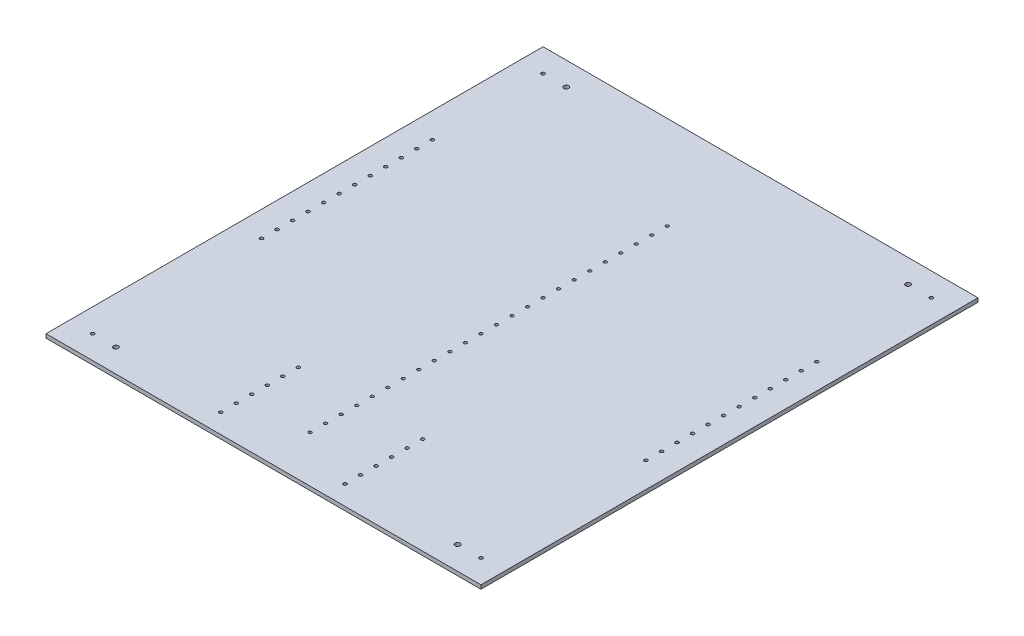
ISO-10303-21;
HEADER;
FILE_DESCRIPTION(('STEP AP214'),'2;1');
FILE_NAME('part.step','',(''),(''),'','','');
FILE_SCHEMA(('AUTOMOTIVE_DESIGN { 1 0 10303 214 1 1 1 1 }'));
ENDSEC;
DATA;
#1=APPLICATION_CONTEXT('core data for automotive mechanical design processes');
#2=APPLICATION_PROTOCOL_DEFINITION('international standard','automotive_design',2000,#1);
#3=PRODUCT_CONTEXT('',#1,'mechanical');
#4=PRODUCT('Part','Part','',(#3));
#5=PRODUCT_RELATED_PRODUCT_CATEGORY('part','',(#4));
#6=PRODUCT_DEFINITION_FORMATION('','',#4);
#7=PRODUCT_DEFINITION_CONTEXT('part definition',#1,'design');
#8=PRODUCT_DEFINITION('design','',#6,#7);
#9=PRODUCT_DEFINITION_SHAPE('','',#8);
#10=(LENGTH_UNIT() NAMED_UNIT(*) SI_UNIT(.MILLI.,.METRE.));
#11=(NAMED_UNIT(*) PLANE_ANGLE_UNIT() SI_UNIT($,.RADIAN.));
#12=(NAMED_UNIT(*) SI_UNIT($,.STERADIAN.) SOLID_ANGLE_UNIT());
#13=UNCERTAINTY_MEASURE_WITH_UNIT(LENGTH_MEASURE(1.E-05),#10,'distance_accuracy_value','');
#14=(GEOMETRIC_REPRESENTATION_CONTEXT(3) GLOBAL_UNCERTAINTY_ASSIGNED_CONTEXT((#13)) GLOBAL_UNIT_ASSIGNED_CONTEXT((#10,
#11,#12)) REPRESENTATION_CONTEXT('',''));
#15=CARTESIAN_POINT('',(0.,0.,0.));
#16=DIRECTION('',(0.,0.,1.));
#17=DIRECTION('',(1.,0.,0.));
#18=AXIS2_PLACEMENT_3D('',#15,#16,#17);
#19=CARTESIAN_POINT('',(355.6,6.35,-406.4));
#20=DIRECTION('',(-1.,0.,0.));
#21=DIRECTION('',(0.,0.,1.));
#22=AXIS2_PLACEMENT_3D('',#19,#20,#21);
#23=PLANE('',#22);
#24=DIRECTION('',(0.,0.,-1.));
#25=VECTOR('',#24,1.);
#26=CARTESIAN_POINT('',(355.6,0.,-406.4));
#27=LINE('',#26,#25);
#28=CARTESIAN_POINT('',(355.6,0.,406.4));
#29=VERTEX_POINT('',#28);
#30=CARTESIAN_POINT('',(355.6,0.,-406.4));
#31=VERTEX_POINT('',#30);
#32=EDGE_CURVE('E105',#29,#31,#27,.T.);
#33=ORIENTED_EDGE('',*,*,#32,.T.);
#34=DIRECTION('',(0.,-1.,0.));
#35=VECTOR('',#34,1.);
#36=CARTESIAN_POINT('',(355.6,6.35,-406.4));
#37=LINE('',#36,#35);
#38=CARTESIAN_POINT('',(355.6,6.35,-406.4));
#39=VERTEX_POINT('',#38);
#40=EDGE_CURVE('E96',#39,#31,#37,.T.);
#41=ORIENTED_EDGE('',*,*,#40,.F.);
#42=DIRECTION('',(0.,0.,-1.));
#43=VECTOR('',#42,1.);
#44=CARTESIAN_POINT('',(355.6,6.35,-406.4));
#45=LINE('',#44,#43);
#46=CARTESIAN_POINT('',(355.6,6.35,406.4));
#47=VERTEX_POINT('',#46);
#48=EDGE_CURVE('E90',#47,#39,#45,.T.);
#49=ORIENTED_EDGE('',*,*,#48,.F.);
#50=DIRECTION('',(0.,-1.,0.));
#51=VECTOR('',#50,1.);
#52=CARTESIAN_POINT('',(355.6,6.35,406.4));
#53=LINE('',#52,#51);
#54=EDGE_CURVE('E101',#47,#29,#53,.T.);
#55=ORIENTED_EDGE('',*,*,#54,.T.);
#56=EDGE_LOOP('',(#33,#41,#49,#55));
#57=FACE_BOUND('',#56,.T.);
#58=ADVANCED_FACE('F36',(#57),#23,.F.);
#59=CARTESIAN_POINT('',(-355.6,6.35,-406.4));
#60=DIRECTION('',(0.,0.,1.));
#61=DIRECTION('',(1.,0.,0.));
#62=AXIS2_PLACEMENT_3D('',#59,#60,#61);
#63=PLANE('',#62);
#64=DIRECTION('',(-1.,0.,0.));
#65=VECTOR('',#64,1.);
#66=CARTESIAN_POINT('',(-355.6,0.,-406.4));
#67=LINE('',#66,#65);
#68=CARTESIAN_POINT('',(-355.6,0.,-406.4));
#69=VERTEX_POINT('',#68);
#70=EDGE_CURVE('E95',#31,#69,#67,.T.);
#71=ORIENTED_EDGE('',*,*,#70,.T.);
#72=DIRECTION('',(0.,-1.,0.));
#73=VECTOR('',#72,1.);
#74=CARTESIAN_POINT('',(-355.6,6.35,-406.4));
#75=LINE('',#74,#73);
#76=CARTESIAN_POINT('',(-355.6,6.35,-406.4));
#77=VERTEX_POINT('',#76);
#78=EDGE_CURVE('E93',#77,#69,#75,.T.);
#79=ORIENTED_EDGE('',*,*,#78,.F.);
#80=DIRECTION('',(-1.,0.,0.));
#81=VECTOR('',#80,1.);
#82=CARTESIAN_POINT('',(-355.6,6.35,-406.4));
#83=LINE('',#82,#81);
#84=EDGE_CURVE('E84',#39,#77,#83,.T.);
#85=ORIENTED_EDGE('',*,*,#84,.F.);
#86=ORIENTED_EDGE('',*,*,#40,.T.);
#87=EDGE_LOOP('',(#71,#79,#85,#86));
#88=FACE_BOUND('',#87,.T.);
#89=ADVANCED_FACE('F94',(#88),#63,.F.);
#90=CARTESIAN_POINT('',(-355.6,6.35,-406.4));
#91=DIRECTION('',(1.,0.,0.));
#92=DIRECTION('',(0.,0.,-1.));
#93=AXIS2_PLACEMENT_3D('',#90,#91,#92);
#94=PLANE('',#93);
#95=DIRECTION('',(0.,0.,1.));
#96=VECTOR('',#95,1.);
#97=CARTESIAN_POINT('',(-355.6,0.,-406.4));
#98=LINE('',#97,#96);
#99=CARTESIAN_POINT('',(-355.6,0.,406.4));
#100=VERTEX_POINT('',#99);
#101=EDGE_CURVE('E70',#69,#100,#98,.T.);
#102=ORIENTED_EDGE('',*,*,#101,.T.);
#103=DIRECTION('',(0.,-1.,0.));
#104=VECTOR('',#103,1.);
#105=CARTESIAN_POINT('',(-355.6,6.35,406.4));
#106=LINE('',#105,#104);
#107=CARTESIAN_POINT('',(-355.6,6.35,406.4));
#108=VERTEX_POINT('',#107);
#109=EDGE_CURVE('E97',#108,#100,#106,.T.);
#110=ORIENTED_EDGE('',*,*,#109,.F.);
#111=DIRECTION('',(0.,0.,1.));
#112=VECTOR('',#111,1.);
#113=CARTESIAN_POINT('',(-355.6,6.35,-406.4));
#114=LINE('',#113,#112);
#115=EDGE_CURVE('E88',#77,#108,#114,.T.);
#116=ORIENTED_EDGE('',*,*,#115,.F.);
#117=ORIENTED_EDGE('',*,*,#78,.T.);
#118=EDGE_LOOP('',(#102,#110,#116,#117));
#119=FACE_BOUND('',#118,.T.);
#120=ADVANCED_FACE('F99',(#119),#94,.F.);
#121=CARTESIAN_POINT('',(-355.6,6.35,406.4));
#122=DIRECTION('',(0.,0.,-1.));
#123=DIRECTION('',(-1.,0.,0.));
#124=AXIS2_PLACEMENT_3D('',#121,#122,#123);
#125=PLANE('',#124);
#126=DIRECTION('',(1.,0.,0.));
#127=VECTOR('',#126,1.);
#128=CARTESIAN_POINT('',(-355.6,0.,406.4));
#129=LINE('',#128,#127);
#130=EDGE_CURVE('E76',#100,#29,#129,.T.);
#131=ORIENTED_EDGE('',*,*,#130,.T.);
#132=ORIENTED_EDGE('',*,*,#54,.F.);
#133=DIRECTION('',(1.,0.,0.));
#134=VECTOR('',#133,1.);
#135=CARTESIAN_POINT('',(-355.6,6.35,406.4));
#136=LINE('',#135,#134);
#137=EDGE_CURVE('E53',#108,#47,#136,.T.);
#138=ORIENTED_EDGE('',*,*,#137,.F.);
#139=ORIENTED_EDGE('',*,*,#109,.T.);
#140=EDGE_LOOP('',(#131,#132,#138,#139));
#141=FACE_BOUND('',#140,.T.);
#142=ADVANCED_FACE('F419',(#141),#125,.F.);
#143=CARTESIAN_POINT('',(0.,6.35,0.));
#144=DIRECTION('',(0.,1.,0.));
#145=DIRECTION('',(0.,0.,1.));
#146=AXIS2_PLACEMENT_3D('',#143,#144,#145);
#147=PLANE('',#146);
#148=CARTESIAN_POINT('',(0.,6.35,-228.6));
#149=DIRECTION('',(0.,1.,0.));
#150=DIRECTION('',(0.,0.,1.));
#151=AXIS2_PLACEMENT_3D('',#148,#149,#150);
#152=CIRCLE('',#151,2.55269999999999);
#153=CARTESIAN_POINT('',(0.,6.35,-226.0473));
#154=VERTEX_POINT('',#153);
#155=EDGE_CURVE('E1376',#154,#154,#152,.T.);
#156=ORIENTED_EDGE('',*,*,#155,.F.);
#157=EDGE_LOOP('',(#156));
#158=FACE_BOUND('',#157,.T.);
#159=CARTESIAN_POINT('',(0.,6.35,-254.));
#160=DIRECTION('',(0.,1.,0.));
#161=DIRECTION('',(0.,0.,1.));
#162=AXIS2_PLACEMENT_3D('',#159,#160,#161);
#163=CIRCLE('',#162,2.55269999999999);
#164=CARTESIAN_POINT('',(0.,6.35,-251.4473));
#165=VERTEX_POINT('',#164);
#166=EDGE_CURVE('E1373',#165,#165,#163,.T.);
#167=ORIENTED_EDGE('',*,*,#166,.F.);
#168=EDGE_LOOP('',(#167));
#169=FACE_BOUND('',#168,.T.);
#170=CARTESIAN_POINT('',(-279.4,6.35,-368.3));
#171=DIRECTION('',(0.,1.,0.));
#172=DIRECTION('',(0.,0.,1.));
#173=AXIS2_PLACEMENT_3D('',#170,#171,#172);
#174=CIRCLE('',#173,3.96875000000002);
#175=CARTESIAN_POINT('',(-279.4,6.35,-364.33125));
#176=VERTEX_POINT('',#175);
#177=EDGE_CURVE('E1367',#176,#176,#174,.T.);
#178=ORIENTED_EDGE('',*,*,#177,.F.);
#179=EDGE_LOOP('',(#178));
#180=FACE_BOUND('',#179,.T.);
#181=CARTESIAN_POINT('',(279.4,6.35,-368.3));
#182=DIRECTION('',(0.,1.,0.));
#183=DIRECTION('',(0.,0.,1.));
#184=AXIS2_PLACEMENT_3D('',#181,#182,#183);
#185=CIRCLE('',#184,3.96875000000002);
#186=CARTESIAN_POINT('',(279.4,6.35,-364.33125));
#187=VERTEX_POINT('',#186);
#188=EDGE_CURVE('E1361',#187,#187,#185,.T.);
#189=ORIENTED_EDGE('',*,*,#188,.F.);
#190=EDGE_LOOP('',(#189));
#191=FACE_BOUND('',#190,.T.);
#192=CARTESIAN_POINT('',(279.4,6.35,368.3));
#193=DIRECTION('',(0.,1.,0.));
#194=DIRECTION('',(0.,0.,1.));
#195=AXIS2_PLACEMENT_3D('',#192,#193,#194);
#196=CIRCLE('',#195,3.96875000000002);
#197=CARTESIAN_POINT('',(279.4,6.35,372.26875));
#198=VERTEX_POINT('',#197);
#199=EDGE_CURVE('E1355',#198,#198,#196,.T.);
#200=ORIENTED_EDGE('',*,*,#199,.F.);
#201=EDGE_LOOP('',(#200));
#202=FACE_BOUND('',#201,.T.);
#203=CARTESIAN_POINT('',(-279.4,6.35,368.3));
#204=DIRECTION('',(0.,1.,0.));
#205=DIRECTION('',(0.,0.,1.));
#206=AXIS2_PLACEMENT_3D('',#203,#204,#205);
#207=CIRCLE('',#206,3.96875000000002);
#208=CARTESIAN_POINT('',(-279.4,6.35,372.26875));
#209=VERTEX_POINT('',#208);
#210=EDGE_CURVE('E1349',#209,#209,#207,.T.);
#211=ORIENTED_EDGE('',*,*,#210,.F.);
#212=EDGE_LOOP('',(#211));
#213=FACE_BOUND('',#212,.T.);
#214=CARTESIAN_POINT('',(101.6,6.35,273.05));
#215=DIRECTION('',(0.,1.,0.));
#216=DIRECTION('',(0.,0.,1.));
#217=AXIS2_PLACEMENT_3D('',#214,#215,#216);
#218=CIRCLE('',#217,2.70509999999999);
#219=CARTESIAN_POINT('',(101.6,6.35,275.7551));
#220=VERTEX_POINT('',#219);
#221=EDGE_CURVE('E1340',#220,#220,#218,.T.);
#222=ORIENTED_EDGE('',*,*,#221,.F.);
#223=EDGE_LOOP('',(#222));
#224=FACE_BOUND('',#223,.T.);
#225=CARTESIAN_POINT('',(-101.6,6.35,273.05));
#226=DIRECTION('',(0.,1.,0.));
#227=DIRECTION('',(0.,0.,1.));
#228=AXIS2_PLACEMENT_3D('',#225,#226,#227);
#229=CIRCLE('',#228,2.70509999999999);
#230=CARTESIAN_POINT('',(-101.6,6.35,275.7551));
#231=VERTEX_POINT('',#230);
#232=EDGE_CURVE('E1334',#231,#231,#229,.T.);
#233=ORIENTED_EDGE('',*,*,#232,.F.);
#234=EDGE_LOOP('',(#233));
#235=FACE_BOUND('',#234,.T.);
#236=CARTESIAN_POINT('',(-101.6,6.35,247.65));
#237=DIRECTION('',(0.,1.,0.));
#238=DIRECTION('',(0.,0.,1.));
#239=AXIS2_PLACEMENT_3D('',#236,#237,#238);
#240=CIRCLE('',#239,2.70509999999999);
#241=CARTESIAN_POINT('',(-101.6,6.35,250.3551));
#242=VERTEX_POINT('',#241);
#243=EDGE_CURVE('E1331',#242,#242,#240,.T.);
#244=ORIENTED_EDGE('',*,*,#243,.F.);
#245=EDGE_LOOP('',(#244));
#246=FACE_BOUND('',#245,.T.);
#247=CARTESIAN_POINT('',(101.6,6.35,247.65));
#248=DIRECTION('',(0.,1.,0.));
#249=DIRECTION('',(0.,0.,1.));
#250=AXIS2_PLACEMENT_3D('',#247,#248,#249);
#251=CIRCLE('',#250,2.70509999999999);
#252=CARTESIAN_POINT('',(101.6,6.35,250.3551));
#253=VERTEX_POINT('',#252);
#254=EDGE_CURVE('E1325',#253,#253,#251,.T.);
#255=ORIENTED_EDGE('',*,*,#254,.F.);
#256=EDGE_LOOP('',(#255));
#257=FACE_BOUND('',#256,.T.);
#258=CARTESIAN_POINT('',(314.325,6.35,-158.75));
#259=DIRECTION('',(0.,1.,0.));
#260=DIRECTION('',(0.,0.,1.));
#261=AXIS2_PLACEMENT_3D('',#258,#259,#260);
#262=CIRCLE('',#261,2.70510000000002);
#263=CARTESIAN_POINT('',(314.325,6.35,-156.0449));
#264=VERTEX_POINT('',#263);
#265=EDGE_CURVE('E1316',#264,#264,#262,.T.);
#266=ORIENTED_EDGE('',*,*,#265,.F.);
#267=EDGE_LOOP('',(#266));
#268=FACE_BOUND('',#267,.T.);
#269=CARTESIAN_POINT('',(-314.325,6.35,-158.75));
#270=DIRECTION('',(0.,1.,0.));
#271=DIRECTION('',(0.,0.,1.));
#272=AXIS2_PLACEMENT_3D('',#269,#270,#271);
#273=CIRCLE('',#272,2.70510000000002);
#274=CARTESIAN_POINT('',(-314.325,6.35,-156.0449));
#275=VERTEX_POINT('',#274);
#276=EDGE_CURVE('E1310',#275,#275,#273,.T.);
#277=ORIENTED_EDGE('',*,*,#276,.F.);
#278=EDGE_LOOP('',(#277));
#279=FACE_BOUND('',#278,.T.);
#280=CARTESIAN_POINT('',(-314.325,6.35,-184.15));
#281=DIRECTION('',(0.,1.,0.));
#282=DIRECTION('',(0.,0.,1.));
#283=AXIS2_PLACEMENT_3D('',#280,#281,#282);
#284=CIRCLE('',#283,2.70510000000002);
#285=CARTESIAN_POINT('',(-314.325,6.35,-181.4449));
#286=VERTEX_POINT('',#285);
#287=EDGE_CURVE('E1307',#286,#286,#284,.T.);
#288=ORIENTED_EDGE('',*,*,#287,.F.);
#289=EDGE_LOOP('',(#288));
#290=FACE_BOUND('',#289,.T.);
#291=CARTESIAN_POINT('',(314.325,6.35,-184.15));
#292=DIRECTION('',(0.,1.,0.));
#293=DIRECTION('',(0.,0.,1.));
#294=AXIS2_PLACEMENT_3D('',#291,#292,#293);
#295=CIRCLE('',#294,2.70510000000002);
#296=CARTESIAN_POINT('',(314.325,6.35,-181.4449));
#297=VERTEX_POINT('',#296);
#298=EDGE_CURVE('E1301',#297,#297,#295,.T.);
#299=ORIENTED_EDGE('',*,*,#298,.F.);
#300=EDGE_LOOP('',(#299));
#301=FACE_BOUND('',#300,.T.);
#302=CARTESIAN_POINT('',(-317.5,6.35,-368.3));
#303=DIRECTION('',(0.,1.,0.));
#304=DIRECTION('',(0.,0.,1.));
#305=AXIS2_PLACEMENT_3D('',#302,#303,#304);
#306=CIRCLE('',#305,2.8067);
#307=CARTESIAN_POINT('',(-317.5,6.35,-365.4933));
#308=VERTEX_POINT('',#307);
#309=EDGE_CURVE('E1295',#308,#308,#306,.T.);
#310=ORIENTED_EDGE('',*,*,#309,.F.);
#311=EDGE_LOOP('',(#310));
#312=FACE_BOUND('',#311,.T.);
#313=CARTESIAN_POINT('',(317.5,6.35,-368.3));
#314=DIRECTION('',(0.,1.,0.));
#315=DIRECTION('',(0.,0.,1.));
#316=AXIS2_PLACEMENT_3D('',#313,#314,#315);
#317=CIRCLE('',#316,2.8067);
#318=CARTESIAN_POINT('',(317.5,6.35,-365.4933));
#319=VERTEX_POINT('',#318);
#320=EDGE_CURVE('E1289',#319,#319,#317,.T.);
#321=ORIENTED_EDGE('',*,*,#320,.F.);
#322=EDGE_LOOP('',(#321));
#323=FACE_BOUND('',#322,.T.);
#324=CARTESIAN_POINT('',(317.5,6.35,368.3));
#325=DIRECTION('',(0.,1.,0.));
#326=DIRECTION('',(0.,0.,1.));
#327=AXIS2_PLACEMENT_3D('',#324,#325,#326);
#328=CIRCLE('',#327,2.8067);
#329=CARTESIAN_POINT('',(317.5,6.35,371.1067));
#330=VERTEX_POINT('',#329);
#331=EDGE_CURVE('E1281',#330,#330,#328,.T.);
#332=ORIENTED_EDGE('',*,*,#331,.F.);
#333=EDGE_LOOP('',(#332));
#334=FACE_BOUND('',#333,.T.);
#335=CARTESIAN_POINT('',(-317.5,6.35,368.3));
#336=DIRECTION('',(0.,1.,0.));
#337=DIRECTION('',(0.,0.,1.));
#338=AXIS2_PLACEMENT_3D('',#335,#336,#337);
#339=CIRCLE('',#338,2.8067);
#340=CARTESIAN_POINT('',(-317.5,6.35,371.1067));
#341=VERTEX_POINT('',#340);
#342=EDGE_CURVE('E1275',#341,#341,#339,.T.);
#343=ORIENTED_EDGE('',*,*,#342,.F.);
#344=EDGE_LOOP('',(#343));
#345=FACE_BOUND('',#344,.T.);
#346=ORIENTED_EDGE('',*,*,#48,.T.);
#347=ORIENTED_EDGE('',*,*,#84,.T.);
#348=ORIENTED_EDGE('',*,*,#115,.T.);
#349=ORIENTED_EDGE('',*,*,#137,.T.);
#350=EDGE_LOOP('',(#346,#347,#348,#349));
#351=FACE_BOUND('',#350,.T.);
#352=CARTESIAN_POINT('',(-314.325,6.35,-133.35));
#353=DIRECTION('',(0.,1.,0.));
#354=DIRECTION('',(0.,0.,1.));
#355=AXIS2_PLACEMENT_3D('',#352,#353,#354);
#356=CIRCLE('',#355,2.70510000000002);
#357=CARTESIAN_POINT('',(-314.325,6.35,-130.6449));
#358=VERTEX_POINT('',#357);
#359=EDGE_CURVE('E118',#358,#358,#356,.T.);
#360=ORIENTED_EDGE('',*,*,#359,.F.);
#361=EDGE_LOOP('',(#360));
#362=FACE_BOUND('',#361,.T.);
#363=CARTESIAN_POINT('',(-314.325,6.35,-107.95));
#364=DIRECTION('',(0.,1.,0.));
#365=DIRECTION('',(0.,0.,1.));
#366=AXIS2_PLACEMENT_3D('',#363,#364,#365);
#367=CIRCLE('',#366,2.70510000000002);
#368=CARTESIAN_POINT('',(-314.325,6.35,-105.2449));
#369=VERTEX_POINT('',#368);
#370=EDGE_CURVE('E124',#369,#369,#367,.T.);
#371=ORIENTED_EDGE('',*,*,#370,.F.);
#372=EDGE_LOOP('',(#371));
#373=FACE_BOUND('',#372,.T.);
#374=CARTESIAN_POINT('',(-314.325,6.35,-82.5500000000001));
#375=DIRECTION('',(0.,1.,0.));
#376=DIRECTION('',(0.,0.,1.));
#377=AXIS2_PLACEMENT_3D('',#374,#375,#376);
#378=CIRCLE('',#377,2.70510000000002);
#379=CARTESIAN_POINT('',(-314.325,6.35,-79.8449000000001));
#380=VERTEX_POINT('',#379);
#381=EDGE_CURVE('E130',#380,#380,#378,.T.);
#382=ORIENTED_EDGE('',*,*,#381,.F.);
#383=EDGE_LOOP('',(#382));
#384=FACE_BOUND('',#383,.T.);
#385=CARTESIAN_POINT('',(-314.325,6.35,-57.1500000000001));
#386=DIRECTION('',(0.,1.,0.));
#387=DIRECTION('',(0.,0.,1.));
#388=AXIS2_PLACEMENT_3D('',#385,#386,#387);
#389=CIRCLE('',#388,2.70510000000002);
#390=CARTESIAN_POINT('',(-314.325,6.35,-54.4449000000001));
#391=VERTEX_POINT('',#390);
#392=EDGE_CURVE('E136',#391,#391,#389,.T.);
#393=ORIENTED_EDGE('',*,*,#392,.F.);
#394=EDGE_LOOP('',(#393));
#395=FACE_BOUND('',#394,.T.);
#396=CARTESIAN_POINT('',(-314.325,6.35,-31.7500000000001));
#397=DIRECTION('',(0.,1.,0.));
#398=DIRECTION('',(0.,0.,1.));
#399=AXIS2_PLACEMENT_3D('',#396,#397,#398);
#400=CIRCLE('',#399,2.70510000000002);
#401=CARTESIAN_POINT('',(-314.325,6.35,-29.0449000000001));
#402=VERTEX_POINT('',#401);
#403=EDGE_CURVE('E142',#402,#402,#400,.T.);
#404=ORIENTED_EDGE('',*,*,#403,.F.);
#405=EDGE_LOOP('',(#404));
#406=FACE_BOUND('',#405,.T.);
#407=CARTESIAN_POINT('',(-314.325,6.35,-6.35000000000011));
#408=DIRECTION('',(0.,1.,0.));
#409=DIRECTION('',(0.,0.,1.));
#410=AXIS2_PLACEMENT_3D('',#407,#408,#409);
#411=CIRCLE('',#410,2.70510000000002);
#412=CARTESIAN_POINT('',(-314.325,6.35,-3.64490000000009));
#413=VERTEX_POINT('',#412);
#414=EDGE_CURVE('E148',#413,#413,#411,.T.);
#415=ORIENTED_EDGE('',*,*,#414,.F.);
#416=EDGE_LOOP('',(#415));
#417=FACE_BOUND('',#416,.T.);
#418=CARTESIAN_POINT('',(-314.325,6.35,19.0499999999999));
#419=DIRECTION('',(0.,1.,0.));
#420=DIRECTION('',(0.,0.,1.));
#421=AXIS2_PLACEMENT_3D('',#418,#419,#420);
#422=CIRCLE('',#421,2.70510000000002);
#423=CARTESIAN_POINT('',(-314.325,6.35,21.7550999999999));
#424=VERTEX_POINT('',#423);
#425=EDGE_CURVE('E154',#424,#424,#422,.T.);
#426=ORIENTED_EDGE('',*,*,#425,.F.);
#427=EDGE_LOOP('',(#426));
#428=FACE_BOUND('',#427,.T.);
#429=CARTESIAN_POINT('',(-314.325,6.35,44.4499999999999));
#430=DIRECTION('',(0.,1.,0.));
#431=DIRECTION('',(0.,0.,1.));
#432=AXIS2_PLACEMENT_3D('',#429,#430,#431);
#433=CIRCLE('',#432,2.70510000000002);
#434=CARTESIAN_POINT('',(-314.325,6.35,47.1550999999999));
#435=VERTEX_POINT('',#434);
#436=EDGE_CURVE('E160',#435,#435,#433,.T.);
#437=ORIENTED_EDGE('',*,*,#436,.F.);
#438=EDGE_LOOP('',(#437));
#439=FACE_BOUND('',#438,.T.);
#440=CARTESIAN_POINT('',(-314.325,6.35,69.8499999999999));
#441=DIRECTION('',(0.,1.,0.));
#442=DIRECTION('',(0.,0.,1.));
#443=AXIS2_PLACEMENT_3D('',#440,#441,#442);
#444=CIRCLE('',#443,2.70510000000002);
#445=CARTESIAN_POINT('',(-314.325,6.35,72.5550999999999));
#446=VERTEX_POINT('',#445);
#447=EDGE_CURVE('E166',#446,#446,#444,.T.);
#448=ORIENTED_EDGE('',*,*,#447,.F.);
#449=EDGE_LOOP('',(#448));
#450=FACE_BOUND('',#449,.T.);
#451=CARTESIAN_POINT('',(-314.325,6.35,95.2499999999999));
#452=DIRECTION('',(0.,1.,0.));
#453=DIRECTION('',(0.,0.,1.));
#454=AXIS2_PLACEMENT_3D('',#451,#452,#453);
#455=CIRCLE('',#454,2.70510000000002);
#456=CARTESIAN_POINT('',(-314.325,6.35,97.9550999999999));
#457=VERTEX_POINT('',#456);
#458=EDGE_CURVE('E172',#457,#457,#455,.T.);
#459=ORIENTED_EDGE('',*,*,#458,.F.);
#460=EDGE_LOOP('',(#459));
#461=FACE_BOUND('',#460,.T.);
#462=CARTESIAN_POINT('',(314.325,6.35,-133.35));
#463=DIRECTION('',(0.,1.,0.));
#464=DIRECTION('',(0.,0.,1.));
#465=AXIS2_PLACEMENT_3D('',#462,#463,#464);
#466=CIRCLE('',#465,2.70510000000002);
#467=CARTESIAN_POINT('',(314.325,6.35,-130.6449));
#468=VERTEX_POINT('',#467);
#469=EDGE_CURVE('E178',#468,#468,#466,.T.);
#470=ORIENTED_EDGE('',*,*,#469,.F.);
#471=EDGE_LOOP('',(#470));
#472=FACE_BOUND('',#471,.T.);
#473=CARTESIAN_POINT('',(314.325,6.35,-107.95));
#474=DIRECTION('',(0.,1.,0.));
#475=DIRECTION('',(0.,0.,1.));
#476=AXIS2_PLACEMENT_3D('',#473,#474,#475);
#477=CIRCLE('',#476,2.70510000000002);
#478=CARTESIAN_POINT('',(314.325,6.35,-105.2449));
#479=VERTEX_POINT('',#478);
#480=EDGE_CURVE('E184',#479,#479,#477,.T.);
#481=ORIENTED_EDGE('',*,*,#480,.F.);
#482=EDGE_LOOP('',(#481));
#483=FACE_BOUND('',#482,.T.);
#484=CARTESIAN_POINT('',(314.325,6.35,-82.5500000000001));
#485=DIRECTION('',(0.,1.,0.));
#486=DIRECTION('',(0.,0.,1.));
#487=AXIS2_PLACEMENT_3D('',#484,#485,#486);
#488=CIRCLE('',#487,2.70510000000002);
#489=CARTESIAN_POINT('',(314.325,6.35,-79.8449000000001));
#490=VERTEX_POINT('',#489);
#491=EDGE_CURVE('E190',#490,#490,#488,.T.);
#492=ORIENTED_EDGE('',*,*,#491,.F.);
#493=EDGE_LOOP('',(#492));
#494=FACE_BOUND('',#493,.T.);
#495=CARTESIAN_POINT('',(314.325,6.35,-57.1500000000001));
#496=DIRECTION('',(0.,1.,0.));
#497=DIRECTION('',(0.,0.,1.));
#498=AXIS2_PLACEMENT_3D('',#495,#496,#497);
#499=CIRCLE('',#498,2.70510000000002);
#500=CARTESIAN_POINT('',(314.325,6.35,-54.4449000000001));
#501=VERTEX_POINT('',#500);
#502=EDGE_CURVE('E196',#501,#501,#499,.T.);
#503=ORIENTED_EDGE('',*,*,#502,.F.);
#504=EDGE_LOOP('',(#503));
#505=FACE_BOUND('',#504,.T.);
#506=CARTESIAN_POINT('',(314.325,6.35,-31.7500000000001));
#507=DIRECTION('',(0.,1.,0.));
#508=DIRECTION('',(0.,0.,1.));
#509=AXIS2_PLACEMENT_3D('',#506,#507,#508);
#510=CIRCLE('',#509,2.70510000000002);
#511=CARTESIAN_POINT('',(314.325,6.35,-29.0449000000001));
#512=VERTEX_POINT('',#511);
#513=EDGE_CURVE('E202',#512,#512,#510,.T.);
#514=ORIENTED_EDGE('',*,*,#513,.F.);
#515=EDGE_LOOP('',(#514));
#516=FACE_BOUND('',#515,.T.);
#517=CARTESIAN_POINT('',(314.325,6.35,-6.35000000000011));
#518=DIRECTION('',(0.,1.,0.));
#519=DIRECTION('',(0.,0.,1.));
#520=AXIS2_PLACEMENT_3D('',#517,#518,#519);
#521=CIRCLE('',#520,2.70510000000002);
#522=CARTESIAN_POINT('',(314.325,6.35,-3.64490000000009));
#523=VERTEX_POINT('',#522);
#524=EDGE_CURVE('E208',#523,#523,#521,.T.);
#525=ORIENTED_EDGE('',*,*,#524,.F.);
#526=EDGE_LOOP('',(#525));
#527=FACE_BOUND('',#526,.T.);
#528=CARTESIAN_POINT('',(314.325,6.35,19.0499999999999));
#529=DIRECTION('',(0.,1.,0.));
#530=DIRECTION('',(0.,0.,1.));
#531=AXIS2_PLACEMENT_3D('',#528,#529,#530);
#532=CIRCLE('',#531,2.70510000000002);
#533=CARTESIAN_POINT('',(314.325,6.35,21.7550999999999));
#534=VERTEX_POINT('',#533);
#535=EDGE_CURVE('E214',#534,#534,#532,.T.);
#536=ORIENTED_EDGE('',*,*,#535,.F.);
#537=EDGE_LOOP('',(#536));
#538=FACE_BOUND('',#537,.T.);
#539=CARTESIAN_POINT('',(314.325,6.35,44.4499999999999));
#540=DIRECTION('',(0.,1.,0.));
#541=DIRECTION('',(0.,0.,1.));
#542=AXIS2_PLACEMENT_3D('',#539,#540,#541);
#543=CIRCLE('',#542,2.70510000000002);
#544=CARTESIAN_POINT('',(314.325,6.35,47.1550999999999));
#545=VERTEX_POINT('',#544);
#546=EDGE_CURVE('E220',#545,#545,#543,.T.);
#547=ORIENTED_EDGE('',*,*,#546,.F.);
#548=EDGE_LOOP('',(#547));
#549=FACE_BOUND('',#548,.T.);
#550=CARTESIAN_POINT('',(314.325,6.35,69.8499999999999));
#551=DIRECTION('',(0.,1.,0.));
#552=DIRECTION('',(0.,0.,1.));
#553=AXIS2_PLACEMENT_3D('',#550,#551,#552);
#554=CIRCLE('',#553,2.70510000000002);
#555=CARTESIAN_POINT('',(314.325,6.35,72.5550999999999));
#556=VERTEX_POINT('',#555);
#557=EDGE_CURVE('E226',#556,#556,#554,.T.);
#558=ORIENTED_EDGE('',*,*,#557,.F.);
#559=EDGE_LOOP('',(#558));
#560=FACE_BOUND('',#559,.T.);
#561=CARTESIAN_POINT('',(314.325,6.35,95.2499999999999));
#562=DIRECTION('',(0.,1.,0.));
#563=DIRECTION('',(0.,0.,1.));
#564=AXIS2_PLACEMENT_3D('',#561,#562,#563);
#565=CIRCLE('',#564,2.70510000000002);
#566=CARTESIAN_POINT('',(314.325,6.35,97.9550999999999));
#567=VERTEX_POINT('',#566);
#568=EDGE_CURVE('E232',#567,#567,#565,.T.);
#569=ORIENTED_EDGE('',*,*,#568,.F.);
#570=EDGE_LOOP('',(#569));
#571=FACE_BOUND('',#570,.T.);
#572=CARTESIAN_POINT('',(-101.6,6.35,298.45));
#573=DIRECTION('',(0.,1.,0.));
#574=DIRECTION('',(0.,0.,1.));
#575=AXIS2_PLACEMENT_3D('',#572,#573,#574);
#576=CIRCLE('',#575,2.70509999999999);
#577=CARTESIAN_POINT('',(-101.6,6.35,301.1551));
#578=VERTEX_POINT('',#577);
#579=EDGE_CURVE('E238',#578,#578,#576,.T.);
#580=ORIENTED_EDGE('',*,*,#579,.F.);
#581=EDGE_LOOP('',(#580));
#582=FACE_BOUND('',#581,.T.);
#583=CARTESIAN_POINT('',(-101.6,6.35,323.85));
#584=DIRECTION('',(0.,1.,0.));
#585=DIRECTION('',(0.,0.,1.));
#586=AXIS2_PLACEMENT_3D('',#583,#584,#585);
#587=CIRCLE('',#586,2.70509999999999);
#588=CARTESIAN_POINT('',(-101.6,6.35,326.5551));
#589=VERTEX_POINT('',#588);
#590=EDGE_CURVE('E244',#589,#589,#587,.T.);
#591=ORIENTED_EDGE('',*,*,#590,.F.);
#592=EDGE_LOOP('',(#591));
#593=FACE_BOUND('',#592,.T.);
#594=CARTESIAN_POINT('',(-101.6,6.35,349.25));
#595=DIRECTION('',(0.,1.,0.));
#596=DIRECTION('',(0.,0.,1.));
#597=AXIS2_PLACEMENT_3D('',#594,#595,#596);
#598=CIRCLE('',#597,2.70509999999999);
#599=CARTESIAN_POINT('',(-101.6,6.35,351.9551));
#600=VERTEX_POINT('',#599);
#601=EDGE_CURVE('E250',#600,#600,#598,.T.);
#602=ORIENTED_EDGE('',*,*,#601,.F.);
#603=EDGE_LOOP('',(#602));
#604=FACE_BOUND('',#603,.T.);
#605=CARTESIAN_POINT('',(-101.6,6.35,374.65));
#606=DIRECTION('',(0.,1.,0.));
#607=DIRECTION('',(0.,0.,1.));
#608=AXIS2_PLACEMENT_3D('',#605,#606,#607);
#609=CIRCLE('',#608,2.70509999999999);
#610=CARTESIAN_POINT('',(-101.6,6.35,377.3551));
#611=VERTEX_POINT('',#610);
#612=EDGE_CURVE('E256',#611,#611,#609,.T.);
#613=ORIENTED_EDGE('',*,*,#612,.F.);
#614=EDGE_LOOP('',(#613));
#615=FACE_BOUND('',#614,.T.);
#616=CARTESIAN_POINT('',(101.6,6.35,298.45));
#617=DIRECTION('',(0.,1.,0.));
#618=DIRECTION('',(0.,0.,1.));
#619=AXIS2_PLACEMENT_3D('',#616,#617,#618);
#620=CIRCLE('',#619,2.70509999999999);
#621=CARTESIAN_POINT('',(101.6,6.35,301.1551));
#622=VERTEX_POINT('',#621);
#623=EDGE_CURVE('E262',#622,#622,#620,.T.);
#624=ORIENTED_EDGE('',*,*,#623,.F.);
#625=EDGE_LOOP('',(#624));
#626=FACE_BOUND('',#625,.T.);
#627=CARTESIAN_POINT('',(101.6,6.35,323.85));
#628=DIRECTION('',(0.,1.,0.));
#629=DIRECTION('',(0.,0.,1.));
#630=AXIS2_PLACEMENT_3D('',#627,#628,#629);
#631=CIRCLE('',#630,2.70509999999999);
#632=CARTESIAN_POINT('',(101.6,6.35,326.5551));
#633=VERTEX_POINT('',#632);
#634=EDGE_CURVE('E268',#633,#633,#631,.T.);
#635=ORIENTED_EDGE('',*,*,#634,.F.);
#636=EDGE_LOOP('',(#635));
#637=FACE_BOUND('',#636,.T.);
#638=CARTESIAN_POINT('',(101.6,6.35,349.25));
#639=DIRECTION('',(0.,1.,0.));
#640=DIRECTION('',(0.,0.,1.));
#641=AXIS2_PLACEMENT_3D('',#638,#639,#640);
#642=CIRCLE('',#641,2.70509999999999);
#643=CARTESIAN_POINT('',(101.6,6.35,351.9551));
#644=VERTEX_POINT('',#643);
#645=EDGE_CURVE('E274',#644,#644,#642,.T.);
#646=ORIENTED_EDGE('',*,*,#645,.F.);
#647=EDGE_LOOP('',(#646));
#648=FACE_BOUND('',#647,.T.);
#649=CARTESIAN_POINT('',(101.6,6.35,374.65));
#650=DIRECTION('',(0.,1.,0.));
#651=DIRECTION('',(0.,0.,1.));
#652=AXIS2_PLACEMENT_3D('',#649,#650,#651);
#653=CIRCLE('',#652,2.70509999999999);
#654=CARTESIAN_POINT('',(101.6,6.35,377.3551));
#655=VERTEX_POINT('',#654);
#656=EDGE_CURVE('E280',#655,#655,#653,.T.);
#657=ORIENTED_EDGE('',*,*,#656,.F.);
#658=EDGE_LOOP('',(#657));
#659=FACE_BOUND('',#658,.T.);
#660=CARTESIAN_POINT('',(0.,6.35,-203.2));
#661=DIRECTION('',(0.,1.,0.));
#662=DIRECTION('',(0.,0.,1.));
#663=AXIS2_PLACEMENT_3D('',#660,#661,#662);
#664=CIRCLE('',#663,2.55269999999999);
#665=CARTESIAN_POINT('',(0.,6.35,-200.6473));
#666=VERTEX_POINT('',#665);
#667=EDGE_CURVE('E286',#666,#666,#664,.T.);
#668=ORIENTED_EDGE('',*,*,#667,.F.);
#669=EDGE_LOOP('',(#668));
#670=FACE_BOUND('',#669,.T.);
#671=CARTESIAN_POINT('',(0.,6.35,-177.8));
#672=DIRECTION('',(0.,1.,0.));
#673=DIRECTION('',(0.,0.,1.));
#674=AXIS2_PLACEMENT_3D('',#671,#672,#673);
#675=CIRCLE('',#674,2.55269999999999);
#676=CARTESIAN_POINT('',(0.,6.35,-175.2473));
#677=VERTEX_POINT('',#676);
#678=EDGE_CURVE('E292',#677,#677,#675,.T.);
#679=ORIENTED_EDGE('',*,*,#678,.F.);
#680=EDGE_LOOP('',(#679));
#681=FACE_BOUND('',#680,.T.);
#682=CARTESIAN_POINT('',(0.,6.35,-152.4));
#683=DIRECTION('',(0.,1.,0.));
#684=DIRECTION('',(0.,0.,1.));
#685=AXIS2_PLACEMENT_3D('',#682,#683,#684);
#686=CIRCLE('',#685,2.55269999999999);
#687=CARTESIAN_POINT('',(0.,6.35,-149.8473));
#688=VERTEX_POINT('',#687);
#689=EDGE_CURVE('E298',#688,#688,#686,.T.);
#690=ORIENTED_EDGE('',*,*,#689,.F.);
#691=EDGE_LOOP('',(#690));
#692=FACE_BOUND('',#691,.T.);
#693=CARTESIAN_POINT('',(0.,6.35,-127.));
#694=DIRECTION('',(0.,1.,0.));
#695=DIRECTION('',(0.,0.,1.));
#696=AXIS2_PLACEMENT_3D('',#693,#694,#695);
#697=CIRCLE('',#696,2.55269999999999);
#698=CARTESIAN_POINT('',(0.,6.35,-124.4473));
#699=VERTEX_POINT('',#698);
#700=EDGE_CURVE('E304',#699,#699,#697,.T.);
#701=ORIENTED_EDGE('',*,*,#700,.F.);
#702=EDGE_LOOP('',(#701));
#703=FACE_BOUND('',#702,.T.);
#704=CARTESIAN_POINT('',(0.,6.35,-101.6));
#705=DIRECTION('',(0.,1.,0.));
#706=DIRECTION('',(0.,0.,1.));
#707=AXIS2_PLACEMENT_3D('',#704,#705,#706);
#708=CIRCLE('',#707,2.55269999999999);
#709=CARTESIAN_POINT('',(0.,6.35,-99.0473000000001));
#710=VERTEX_POINT('',#709);
#711=EDGE_CURVE('E310',#710,#710,#708,.T.);
#712=ORIENTED_EDGE('',*,*,#711,.F.);
#713=EDGE_LOOP('',(#712));
#714=FACE_BOUND('',#713,.T.);
#715=CARTESIAN_POINT('',(0.,6.35,-76.2000000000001));
#716=DIRECTION('',(0.,1.,0.));
#717=DIRECTION('',(0.,0.,1.));
#718=AXIS2_PLACEMENT_3D('',#715,#716,#717);
#719=CIRCLE('',#718,2.55269999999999);
#720=CARTESIAN_POINT('',(0.,6.35,-73.6473000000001));
#721=VERTEX_POINT('',#720);
#722=EDGE_CURVE('E316',#721,#721,#719,.T.);
#723=ORIENTED_EDGE('',*,*,#722,.F.);
#724=EDGE_LOOP('',(#723));
#725=FACE_BOUND('',#724,.T.);
#726=CARTESIAN_POINT('',(0.,6.35,-50.8000000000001));
#727=DIRECTION('',(0.,1.,0.));
#728=DIRECTION('',(0.,0.,1.));
#729=AXIS2_PLACEMENT_3D('',#726,#727,#728);
#730=CIRCLE('',#729,2.55269999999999);
#731=CARTESIAN_POINT('',(0.,6.35,-48.2473000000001));
#732=VERTEX_POINT('',#731);
#733=EDGE_CURVE('E322',#732,#732,#730,.T.);
#734=ORIENTED_EDGE('',*,*,#733,.F.);
#735=EDGE_LOOP('',(#734));
#736=FACE_BOUND('',#735,.T.);
#737=CARTESIAN_POINT('',(0.,6.35,-25.4000000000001));
#738=DIRECTION('',(0.,1.,0.));
#739=DIRECTION('',(0.,0.,1.));
#740=AXIS2_PLACEMENT_3D('',#737,#738,#739);
#741=CIRCLE('',#740,2.55269999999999);
#742=CARTESIAN_POINT('',(0.,6.35,-22.8473000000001));
#743=VERTEX_POINT('',#742);
#744=EDGE_CURVE('E328',#743,#743,#741,.T.);
#745=ORIENTED_EDGE('',*,*,#744,.F.);
#746=EDGE_LOOP('',(#745));
#747=FACE_BOUND('',#746,.T.);
#748=CARTESIAN_POINT('',(0.,6.35,-1.11022302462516E-13));
#749=DIRECTION('',(0.,1.,0.));
#750=DIRECTION('',(0.,0.,1.));
#751=AXIS2_PLACEMENT_3D('',#748,#749,#750);
#752=CIRCLE('',#751,2.55269999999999);
#753=CARTESIAN_POINT('',(0.,6.35,2.55269999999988));
#754=VERTEX_POINT('',#753);
#755=EDGE_CURVE('E334',#754,#754,#752,.T.);
#756=ORIENTED_EDGE('',*,*,#755,.F.);
#757=EDGE_LOOP('',(#756));
#758=FACE_BOUND('',#757,.T.);
#759=CARTESIAN_POINT('',(0.,6.35,25.3999999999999));
#760=DIRECTION('',(0.,1.,0.));
#761=DIRECTION('',(0.,0.,1.));
#762=AXIS2_PLACEMENT_3D('',#759,#760,#761);
#763=CIRCLE('',#762,2.55269999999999);
#764=CARTESIAN_POINT('',(0.,6.35,27.9526999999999));
#765=VERTEX_POINT('',#764);
#766=EDGE_CURVE('E340',#765,#765,#763,.T.);
#767=ORIENTED_EDGE('',*,*,#766,.F.);
#768=EDGE_LOOP('',(#767));
#769=FACE_BOUND('',#768,.T.);
#770=CARTESIAN_POINT('',(0.,6.35,50.7999999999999));
#771=DIRECTION('',(0.,1.,0.));
#772=DIRECTION('',(0.,0.,1.));
#773=AXIS2_PLACEMENT_3D('',#770,#771,#772);
#774=CIRCLE('',#773,2.55269999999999);
#775=CARTESIAN_POINT('',(0.,6.35,53.3526999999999));
#776=VERTEX_POINT('',#775);
#777=EDGE_CURVE('E346',#776,#776,#774,.T.);
#778=ORIENTED_EDGE('',*,*,#777,.F.);
#779=EDGE_LOOP('',(#778));
#780=FACE_BOUND('',#779,.T.);
#781=CARTESIAN_POINT('',(0.,6.35,76.1999999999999));
#782=DIRECTION('',(0.,1.,0.));
#783=DIRECTION('',(0.,0.,1.));
#784=AXIS2_PLACEMENT_3D('',#781,#782,#783);
#785=CIRCLE('',#784,2.55269999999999);
#786=CARTESIAN_POINT('',(0.,6.35,78.7526999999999));
#787=VERTEX_POINT('',#786);
#788=EDGE_CURVE('E352',#787,#787,#785,.T.);
#789=ORIENTED_EDGE('',*,*,#788,.F.);
#790=EDGE_LOOP('',(#789));
#791=FACE_BOUND('',#790,.T.);
#792=CARTESIAN_POINT('',(0.,6.35,101.6));
#793=DIRECTION('',(0.,1.,0.));
#794=DIRECTION('',(0.,0.,1.));
#795=AXIS2_PLACEMENT_3D('',#792,#793,#794);
#796=CIRCLE('',#795,2.55269999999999);
#797=CARTESIAN_POINT('',(0.,6.35,104.1527));
#798=VERTEX_POINT('',#797);
#799=EDGE_CURVE('E358',#798,#798,#796,.T.);
#800=ORIENTED_EDGE('',*,*,#799,.F.);
#801=EDGE_LOOP('',(#800));
#802=FACE_BOUND('',#801,.T.);
#803=CARTESIAN_POINT('',(0.,6.35,127.));
#804=DIRECTION('',(0.,1.,0.));
#805=DIRECTION('',(0.,0.,1.));
#806=AXIS2_PLACEMENT_3D('',#803,#804,#805);
#807=CIRCLE('',#806,2.55269999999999);
#808=CARTESIAN_POINT('',(0.,6.35,129.5527));
#809=VERTEX_POINT('',#808);
#810=EDGE_CURVE('E364',#809,#809,#807,.T.);
#811=ORIENTED_EDGE('',*,*,#810,.F.);
#812=EDGE_LOOP('',(#811));
#813=FACE_BOUND('',#812,.T.);
#814=CARTESIAN_POINT('',(0.,6.35,152.4));
#815=DIRECTION('',(0.,1.,0.));
#816=DIRECTION('',(0.,0.,1.));
#817=AXIS2_PLACEMENT_3D('',#814,#815,#816);
#818=CIRCLE('',#817,2.55269999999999);
#819=CARTESIAN_POINT('',(0.,6.35,154.9527));
#820=VERTEX_POINT('',#819);
#821=EDGE_CURVE('E370',#820,#820,#818,.T.);
#822=ORIENTED_EDGE('',*,*,#821,.F.);
#823=EDGE_LOOP('',(#822));
#824=FACE_BOUND('',#823,.T.);
#825=CARTESIAN_POINT('',(0.,6.35,177.8));
#826=DIRECTION('',(0.,1.,0.));
#827=DIRECTION('',(0.,0.,1.));
#828=AXIS2_PLACEMENT_3D('',#825,#826,#827);
#829=CIRCLE('',#828,2.55269999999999);
#830=CARTESIAN_POINT('',(0.,6.35,180.3527));
#831=VERTEX_POINT('',#830);
#832=EDGE_CURVE('E376',#831,#831,#829,.T.);
#833=ORIENTED_EDGE('',*,*,#832,.F.);
#834=EDGE_LOOP('',(#833));
#835=FACE_BOUND('',#834,.T.);
#836=CARTESIAN_POINT('',(0.,6.35,203.2));
#837=DIRECTION('',(0.,1.,0.));
#838=DIRECTION('',(0.,0.,1.));
#839=AXIS2_PLACEMENT_3D('',#836,#837,#838);
#840=CIRCLE('',#839,2.55269999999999);
#841=CARTESIAN_POINT('',(0.,6.35,205.7527));
#842=VERTEX_POINT('',#841);
#843=EDGE_CURVE('E382',#842,#842,#840,.T.);
#844=ORIENTED_EDGE('',*,*,#843,.F.);
#845=EDGE_LOOP('',(#844));
#846=FACE_BOUND('',#845,.T.);
#847=CARTESIAN_POINT('',(0.,6.35,228.6));
#848=DIRECTION('',(0.,1.,0.));
#849=DIRECTION('',(0.,0.,1.));
#850=AXIS2_PLACEMENT_3D('',#847,#848,#849);
#851=CIRCLE('',#850,2.55269999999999);
#852=CARTESIAN_POINT('',(0.,6.35,231.1527));
#853=VERTEX_POINT('',#852);
#854=EDGE_CURVE('E388',#853,#853,#851,.T.);
#855=ORIENTED_EDGE('',*,*,#854,.F.);
#856=EDGE_LOOP('',(#855));
#857=FACE_BOUND('',#856,.T.);
#858=CARTESIAN_POINT('',(0.,6.35,254.));
#859=DIRECTION('',(0.,1.,0.));
#860=DIRECTION('',(0.,0.,1.));
#861=AXIS2_PLACEMENT_3D('',#858,#859,#860);
#862=CIRCLE('',#861,2.55269999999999);
#863=CARTESIAN_POINT('',(0.,6.35,256.5527));
#864=VERTEX_POINT('',#863);
#865=EDGE_CURVE('E394',#864,#864,#862,.T.);
#866=ORIENTED_EDGE('',*,*,#865,.F.);
#867=EDGE_LOOP('',(#866));
#868=FACE_BOUND('',#867,.T.);
#869=CARTESIAN_POINT('',(0.,6.35,279.4));
#870=DIRECTION('',(0.,1.,0.));
#871=DIRECTION('',(0.,0.,1.));
#872=AXIS2_PLACEMENT_3D('',#869,#870,#871);
#873=CIRCLE('',#872,2.55269999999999);
#874=CARTESIAN_POINT('',(0.,6.35,281.9527));
#875=VERTEX_POINT('',#874);
#876=EDGE_CURVE('E400',#875,#875,#873,.T.);
#877=ORIENTED_EDGE('',*,*,#876,.F.);
#878=EDGE_LOOP('',(#877));
#879=FACE_BOUND('',#878,.T.);
#880=CARTESIAN_POINT('',(0.,6.35,304.8));
#881=DIRECTION('',(0.,1.,0.));
#882=DIRECTION('',(0.,0.,1.));
#883=AXIS2_PLACEMENT_3D('',#880,#881,#882);
#884=CIRCLE('',#883,2.55269999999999);
#885=CARTESIAN_POINT('',(0.,6.35,307.3527));
#886=VERTEX_POINT('',#885);
#887=EDGE_CURVE('E406',#886,#886,#884,.T.);
#888=ORIENTED_EDGE('',*,*,#887,.F.);
#889=EDGE_LOOP('',(#888));
#890=FACE_BOUND('',#889,.T.);
#891=CARTESIAN_POINT('',(0.,6.35,330.2));
#892=DIRECTION('',(0.,1.,0.));
#893=DIRECTION('',(0.,0.,1.));
#894=AXIS2_PLACEMENT_3D('',#891,#892,#893);
#895=CIRCLE('',#894,2.55269999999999);
#896=CARTESIAN_POINT('',(0.,6.35,332.7527));
#897=VERTEX_POINT('',#896);
#898=EDGE_CURVE('E11',#897,#897,#895,.T.);
#899=ORIENTED_EDGE('',*,*,#898,.F.);
#900=EDGE_LOOP('',(#899));
#901=FACE_BOUND('',#900,.T.);
#902=ADVANCED_FACE('F85',(#158,#169,#180,#191,#202,#213,#224,#235,#246,#257,#268,#279,#290,#301,
#312,#323,#334,#345,#351,#362,#373,#384,#395,#406,#417,#428,#439,#450,#461,#472,#483,#494,#505,
#516,#527,#538,#549,#560,#571,#582,#593,#604,#615,#626,#637,#648,#659,#670,#681,#692,#703,#714,
#725,#736,#747,#758,#769,#780,#791,#802,#813,#824,#835,#846,#857,#868,#879,#890,#901),#147,.T.);
#903=CARTESIAN_POINT('',(0.,0.,0.));
#904=DIRECTION('',(0.,1.,0.));
#905=DIRECTION('',(0.,0.,1.));
#906=AXIS2_PLACEMENT_3D('',#903,#904,#905);
#907=PLANE('',#906);
#908=CARTESIAN_POINT('',(0.,0.,-228.6));
#909=DIRECTION('',(0.,1.,0.));
#910=DIRECTION('',(0.,0.,1.));
#911=AXIS2_PLACEMENT_3D('',#908,#909,#910);
#912=CIRCLE('',#911,2.5527);
#913=CARTESIAN_POINT('',(0.,0.,-226.0473));
#914=VERTEX_POINT('',#913);
#915=EDGE_CURVE('E1379',#914,#914,#912,.T.);
#916=ORIENTED_EDGE('',*,*,#915,.T.);
#917=EDGE_LOOP('',(#916));
#918=FACE_BOUND('',#917,.T.);
#919=CARTESIAN_POINT('',(0.,0.,-254.));
#920=DIRECTION('',(0.,1.,0.));
#921=DIRECTION('',(0.,0.,1.));
#922=AXIS2_PLACEMENT_3D('',#919,#920,#921);
#923=CIRCLE('',#922,2.5527);
#924=CARTESIAN_POINT('',(0.,0.,-251.4473));
#925=VERTEX_POINT('',#924);
#926=EDGE_CURVE('E1370',#925,#925,#923,.T.);
#927=ORIENTED_EDGE('',*,*,#926,.T.);
#928=EDGE_LOOP('',(#927));
#929=FACE_BOUND('',#928,.T.);
#930=CARTESIAN_POINT('',(-279.4,0.,-368.3));
#931=DIRECTION('',(0.,1.,0.));
#932=DIRECTION('',(0.,0.,1.));
#933=AXIS2_PLACEMENT_3D('',#930,#931,#932);
#934=CIRCLE('',#933,3.96875000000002);
#935=CARTESIAN_POINT('',(-279.4,0.,-364.33125));
#936=VERTEX_POINT('',#935);
#937=EDGE_CURVE('E1364',#936,#936,#934,.T.);
#938=ORIENTED_EDGE('',*,*,#937,.T.);
#939=EDGE_LOOP('',(#938));
#940=FACE_BOUND('',#939,.T.);
#941=CARTESIAN_POINT('',(279.4,0.,-368.3));
#942=DIRECTION('',(0.,1.,0.));
#943=DIRECTION('',(0.,0.,1.));
#944=AXIS2_PLACEMENT_3D('',#941,#942,#943);
#945=CIRCLE('',#944,3.96875000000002);
#946=CARTESIAN_POINT('',(279.4,0.,-364.33125));
#947=VERTEX_POINT('',#946);
#948=EDGE_CURVE('E1358',#947,#947,#945,.T.);
#949=ORIENTED_EDGE('',*,*,#948,.T.);
#950=EDGE_LOOP('',(#949));
#951=FACE_BOUND('',#950,.T.);
#952=CARTESIAN_POINT('',(279.4,0.,368.3));
#953=DIRECTION('',(0.,1.,0.));
#954=DIRECTION('',(0.,0.,1.));
#955=AXIS2_PLACEMENT_3D('',#952,#953,#954);
#956=CIRCLE('',#955,3.96875000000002);
#957=CARTESIAN_POINT('',(279.4,0.,372.26875));
#958=VERTEX_POINT('',#957);
#959=EDGE_CURVE('E1352',#958,#958,#956,.T.);
#960=ORIENTED_EDGE('',*,*,#959,.T.);
#961=EDGE_LOOP('',(#960));
#962=FACE_BOUND('',#961,.T.);
#963=CARTESIAN_POINT('',(-279.4,0.,368.3));
#964=DIRECTION('',(0.,1.,0.));
#965=DIRECTION('',(0.,0.,1.));
#966=AXIS2_PLACEMENT_3D('',#963,#964,#965);
#967=CIRCLE('',#966,3.96875000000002);
#968=CARTESIAN_POINT('',(-279.4,0.,372.26875));
#969=VERTEX_POINT('',#968);
#970=EDGE_CURVE('E1346',#969,#969,#967,.T.);
#971=ORIENTED_EDGE('',*,*,#970,.T.);
#972=EDGE_LOOP('',(#971));
#973=FACE_BOUND('',#972,.T.);
#974=CARTESIAN_POINT('',(101.6,0.,273.05));
#975=DIRECTION('',(0.,1.,0.));
#976=DIRECTION('',(0.,0.,1.));
#977=AXIS2_PLACEMENT_3D('',#974,#975,#976);
#978=CIRCLE('',#977,2.7051);
#979=CARTESIAN_POINT('',(101.6,0.,275.7551));
#980=VERTEX_POINT('',#979);
#981=EDGE_CURVE('E1343',#980,#980,#978,.T.);
#982=ORIENTED_EDGE('',*,*,#981,.T.);
#983=EDGE_LOOP('',(#982));
#984=FACE_BOUND('',#983,.T.);
#985=CARTESIAN_POINT('',(-101.6,0.,273.05));
#986=DIRECTION('',(0.,1.,0.));
#987=DIRECTION('',(0.,0.,1.));
#988=AXIS2_PLACEMENT_3D('',#985,#986,#987);
#989=CIRCLE('',#988,2.7051);
#990=CARTESIAN_POINT('',(-101.6,0.,275.7551));
#991=VERTEX_POINT('',#990);
#992=EDGE_CURVE('E1337',#991,#991,#989,.T.);
#993=ORIENTED_EDGE('',*,*,#992,.T.);
#994=EDGE_LOOP('',(#993));
#995=FACE_BOUND('',#994,.T.);
#996=CARTESIAN_POINT('',(-101.6,0.,247.65));
#997=DIRECTION('',(0.,1.,0.));
#998=DIRECTION('',(0.,0.,1.));
#999=AXIS2_PLACEMENT_3D('',#996,#997,#998);
#1000=CIRCLE('',#999,2.7051);
#1001=CARTESIAN_POINT('',(-101.6,0.,250.3551));
#1002=VERTEX_POINT('',#1001);
#1003=EDGE_CURVE('E1328',#1002,#1002,#1000,.T.);
#1004=ORIENTED_EDGE('',*,*,#1003,.T.);
#1005=EDGE_LOOP('',(#1004));
#1006=FACE_BOUND('',#1005,.T.);
#1007=CARTESIAN_POINT('',(101.6,0.,247.65));
#1008=DIRECTION('',(0.,1.,0.));
#1009=DIRECTION('',(0.,0.,1.));
#1010=AXIS2_PLACEMENT_3D('',#1007,#1008,#1009);
#1011=CIRCLE('',#1010,2.7051);
#1012=CARTESIAN_POINT('',(101.6,0.,250.3551));
#1013=VERTEX_POINT('',#1012);
#1014=EDGE_CURVE('E1322',#1013,#1013,#1011,.T.);
#1015=ORIENTED_EDGE('',*,*,#1014,.T.);
#1016=EDGE_LOOP('',(#1015));
#1017=FACE_BOUND('',#1016,.T.);
#1018=CARTESIAN_POINT('',(314.325,0.,-158.75));
#1019=DIRECTION('',(0.,1.,0.));
#1020=DIRECTION('',(0.,0.,1.));
#1021=AXIS2_PLACEMENT_3D('',#1018,#1019,#1020);
#1022=CIRCLE('',#1021,2.70510000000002);
#1023=CARTESIAN_POINT('',(314.325,0.,-156.0449));
#1024=VERTEX_POINT('',#1023);
#1025=EDGE_CURVE('E1319',#1024,#1024,#1022,.T.);
#1026=ORIENTED_EDGE('',*,*,#1025,.T.);
#1027=EDGE_LOOP('',(#1026));
#1028=FACE_BOUND('',#1027,.T.);
#1029=CARTESIAN_POINT('',(-314.325,0.,-158.75));
#1030=DIRECTION('',(0.,1.,0.));
#1031=DIRECTION('',(0.,0.,1.));
#1032=AXIS2_PLACEMENT_3D('',#1029,#1030,#1031);
#1033=CIRCLE('',#1032,2.70510000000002);
#1034=CARTESIAN_POINT('',(-314.325,0.,-156.0449));
#1035=VERTEX_POINT('',#1034);
#1036=EDGE_CURVE('E1313',#1035,#1035,#1033,.T.);
#1037=ORIENTED_EDGE('',*,*,#1036,.T.);
#1038=EDGE_LOOP('',(#1037));
#1039=FACE_BOUND('',#1038,.T.);
#1040=CARTESIAN_POINT('',(-314.325,0.,-184.15));
#1041=DIRECTION('',(0.,1.,0.));
#1042=DIRECTION('',(0.,0.,1.));
#1043=AXIS2_PLACEMENT_3D('',#1040,#1041,#1042);
#1044=CIRCLE('',#1043,2.70510000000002);
#1045=CARTESIAN_POINT('',(-314.325,0.,-181.4449));
#1046=VERTEX_POINT('',#1045);
#1047=EDGE_CURVE('E1304',#1046,#1046,#1044,.T.);
#1048=ORIENTED_EDGE('',*,*,#1047,.T.);
#1049=EDGE_LOOP('',(#1048));
#1050=FACE_BOUND('',#1049,.T.);
#1051=CARTESIAN_POINT('',(314.325,0.,-184.15));
#1052=DIRECTION('',(0.,1.,0.));
#1053=DIRECTION('',(0.,0.,1.));
#1054=AXIS2_PLACEMENT_3D('',#1051,#1052,#1053);
#1055=CIRCLE('',#1054,2.70510000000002);
#1056=CARTESIAN_POINT('',(314.325,0.,-181.4449));
#1057=VERTEX_POINT('',#1056);
#1058=EDGE_CURVE('E1298',#1057,#1057,#1055,.T.);
#1059=ORIENTED_EDGE('',*,*,#1058,.T.);
#1060=EDGE_LOOP('',(#1059));
#1061=FACE_BOUND('',#1060,.T.);
#1062=CARTESIAN_POINT('',(-317.5,0.,-368.3));
#1063=DIRECTION('',(0.,1.,0.));
#1064=DIRECTION('',(0.,0.,1.));
#1065=AXIS2_PLACEMENT_3D('',#1062,#1063,#1064);
#1066=CIRCLE('',#1065,2.8067);
#1067=CARTESIAN_POINT('',(-317.5,0.,-365.4933));
#1068=VERTEX_POINT('',#1067);
#1069=EDGE_CURVE('E1292',#1068,#1068,#1066,.T.);
#1070=ORIENTED_EDGE('',*,*,#1069,.T.);
#1071=EDGE_LOOP('',(#1070));
#1072=FACE_BOUND('',#1071,.T.);
#1073=CARTESIAN_POINT('',(317.5,0.,-368.3));
#1074=DIRECTION('',(0.,1.,0.));
#1075=DIRECTION('',(0.,0.,1.));
#1076=AXIS2_PLACEMENT_3D('',#1073,#1074,#1075);
#1077=CIRCLE('',#1076,2.8067);
#1078=CARTESIAN_POINT('',(317.5,0.,-365.4933));
#1079=VERTEX_POINT('',#1078);
#1080=EDGE_CURVE('E1286',#1079,#1079,#1077,.T.);
#1081=ORIENTED_EDGE('',*,*,#1080,.T.);
#1082=EDGE_LOOP('',(#1081));
#1083=FACE_BOUND('',#1082,.T.);
#1084=CARTESIAN_POINT('',(317.5,0.,368.3));
#1085=DIRECTION('',(0.,1.,0.));
#1086=DIRECTION('',(0.,0.,1.));
#1087=AXIS2_PLACEMENT_3D('',#1084,#1085,#1086);
#1088=CIRCLE('',#1087,2.8067);
#1089=CARTESIAN_POINT('',(317.5,0.,371.1067));
#1090=VERTEX_POINT('',#1089);
#1091=EDGE_CURVE('E1277',#1090,#1090,#1088,.T.);
#1092=ORIENTED_EDGE('',*,*,#1091,.T.);
#1093=EDGE_LOOP('',(#1092));
#1094=FACE_BOUND('',#1093,.T.);
#1095=CARTESIAN_POINT('',(-317.5,0.,368.3));
#1096=DIRECTION('',(0.,1.,0.));
#1097=DIRECTION('',(0.,0.,1.));
#1098=AXIS2_PLACEMENT_3D('',#1095,#1096,#1097);
#1099=CIRCLE('',#1098,2.8067);
#1100=CARTESIAN_POINT('',(-317.5,0.,371.1067));
#1101=VERTEX_POINT('',#1100);
#1102=EDGE_CURVE('E108',#1101,#1101,#1099,.T.);
#1103=ORIENTED_EDGE('',*,*,#1102,.T.);
#1104=EDGE_LOOP('',(#1103));
#1105=FACE_BOUND('',#1104,.T.);
#1106=ORIENTED_EDGE('',*,*,#32,.F.);
#1107=ORIENTED_EDGE('',*,*,#130,.F.);
#1108=ORIENTED_EDGE('',*,*,#101,.F.);
#1109=ORIENTED_EDGE('',*,*,#70,.F.);
#1110=EDGE_LOOP('',(#1106,#1107,#1108,#1109));
#1111=FACE_BOUND('',#1110,.T.);
#1112=CARTESIAN_POINT('',(-314.325,0.,-133.35));
#1113=DIRECTION('',(0.,1.,0.));
#1114=DIRECTION('',(0.,0.,1.));
#1115=AXIS2_PLACEMENT_3D('',#1112,#1113,#1114);
#1116=CIRCLE('',#1115,2.70510000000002);
#1117=CARTESIAN_POINT('',(-314.325,0.,-130.6449));
#1118=VERTEX_POINT('',#1117);
#1119=EDGE_CURVE('E115',#1118,#1118,#1116,.T.);
#1120=ORIENTED_EDGE('',*,*,#1119,.T.);
#1121=EDGE_LOOP('',(#1120));
#1122=FACE_BOUND('',#1121,.T.);
#1123=CARTESIAN_POINT('',(-314.325,0.,-107.95));
#1124=DIRECTION('',(0.,1.,0.));
#1125=DIRECTION('',(0.,0.,1.));
#1126=AXIS2_PLACEMENT_3D('',#1123,#1124,#1125);
#1127=CIRCLE('',#1126,2.70510000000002);
#1128=CARTESIAN_POINT('',(-314.325,0.,-105.2449));
#1129=VERTEX_POINT('',#1128);
#1130=EDGE_CURVE('E121',#1129,#1129,#1127,.T.);
#1131=ORIENTED_EDGE('',*,*,#1130,.T.);
#1132=EDGE_LOOP('',(#1131));
#1133=FACE_BOUND('',#1132,.T.);
#1134=CARTESIAN_POINT('',(-314.325,0.,-82.5500000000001));
#1135=DIRECTION('',(0.,1.,0.));
#1136=DIRECTION('',(0.,0.,1.));
#1137=AXIS2_PLACEMENT_3D('',#1134,#1135,#1136);
#1138=CIRCLE('',#1137,2.70510000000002);
#1139=CARTESIAN_POINT('',(-314.325,0.,-79.8449000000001));
#1140=VERTEX_POINT('',#1139);
#1141=EDGE_CURVE('E127',#1140,#1140,#1138,.T.);
#1142=ORIENTED_EDGE('',*,*,#1141,.T.);
#1143=EDGE_LOOP('',(#1142));
#1144=FACE_BOUND('',#1143,.T.);
#1145=CARTESIAN_POINT('',(-314.325,0.,-57.1500000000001));
#1146=DIRECTION('',(0.,1.,0.));
#1147=DIRECTION('',(0.,0.,1.));
#1148=AXIS2_PLACEMENT_3D('',#1145,#1146,#1147);
#1149=CIRCLE('',#1148,2.70510000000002);
#1150=CARTESIAN_POINT('',(-314.325,0.,-54.4449000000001));
#1151=VERTEX_POINT('',#1150);
#1152=EDGE_CURVE('E133',#1151,#1151,#1149,.T.);
#1153=ORIENTED_EDGE('',*,*,#1152,.T.);
#1154=EDGE_LOOP('',(#1153));
#1155=FACE_BOUND('',#1154,.T.);
#1156=CARTESIAN_POINT('',(-314.325,0.,-31.7500000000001));
#1157=DIRECTION('',(0.,1.,0.));
#1158=DIRECTION('',(0.,0.,1.));
#1159=AXIS2_PLACEMENT_3D('',#1156,#1157,#1158);
#1160=CIRCLE('',#1159,2.70510000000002);
#1161=CARTESIAN_POINT('',(-314.325,0.,-29.0449000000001));
#1162=VERTEX_POINT('',#1161);
#1163=EDGE_CURVE('E139',#1162,#1162,#1160,.T.);
#1164=ORIENTED_EDGE('',*,*,#1163,.T.);
#1165=EDGE_LOOP('',(#1164));
#1166=FACE_BOUND('',#1165,.T.);
#1167=CARTESIAN_POINT('',(-314.325,0.,-6.35000000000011));
#1168=DIRECTION('',(0.,1.,0.));
#1169=DIRECTION('',(0.,0.,1.));
#1170=AXIS2_PLACEMENT_3D('',#1167,#1168,#1169);
#1171=CIRCLE('',#1170,2.70510000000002);
#1172=CARTESIAN_POINT('',(-314.325,0.,-3.64490000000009));
#1173=VERTEX_POINT('',#1172);
#1174=EDGE_CURVE('E145',#1173,#1173,#1171,.T.);
#1175=ORIENTED_EDGE('',*,*,#1174,.T.);
#1176=EDGE_LOOP('',(#1175));
#1177=FACE_BOUND('',#1176,.T.);
#1178=CARTESIAN_POINT('',(-314.325,0.,19.0499999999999));
#1179=DIRECTION('',(0.,1.,0.));
#1180=DIRECTION('',(0.,0.,1.));
#1181=AXIS2_PLACEMENT_3D('',#1178,#1179,#1180);
#1182=CIRCLE('',#1181,2.70510000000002);
#1183=CARTESIAN_POINT('',(-314.325,0.,21.7550999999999));
#1184=VERTEX_POINT('',#1183);
#1185=EDGE_CURVE('E151',#1184,#1184,#1182,.T.);
#1186=ORIENTED_EDGE('',*,*,#1185,.T.);
#1187=EDGE_LOOP('',(#1186));
#1188=FACE_BOUND('',#1187,.T.);
#1189=CARTESIAN_POINT('',(-314.325,0.,44.4499999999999));
#1190=DIRECTION('',(0.,1.,0.));
#1191=DIRECTION('',(0.,0.,1.));
#1192=AXIS2_PLACEMENT_3D('',#1189,#1190,#1191);
#1193=CIRCLE('',#1192,2.70510000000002);
#1194=CARTESIAN_POINT('',(-314.325,0.,47.1550999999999));
#1195=VERTEX_POINT('',#1194);
#1196=EDGE_CURVE('E157',#1195,#1195,#1193,.T.);
#1197=ORIENTED_EDGE('',*,*,#1196,.T.);
#1198=EDGE_LOOP('',(#1197));
#1199=FACE_BOUND('',#1198,.T.);
#1200=CARTESIAN_POINT('',(-314.325,0.,69.8499999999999));
#1201=DIRECTION('',(0.,1.,0.));
#1202=DIRECTION('',(0.,0.,1.));
#1203=AXIS2_PLACEMENT_3D('',#1200,#1201,#1202);
#1204=CIRCLE('',#1203,2.70510000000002);
#1205=CARTESIAN_POINT('',(-314.325,0.,72.5550999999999));
#1206=VERTEX_POINT('',#1205);
#1207=EDGE_CURVE('E163',#1206,#1206,#1204,.T.);
#1208=ORIENTED_EDGE('',*,*,#1207,.T.);
#1209=EDGE_LOOP('',(#1208));
#1210=FACE_BOUND('',#1209,.T.);
#1211=CARTESIAN_POINT('',(-314.325,0.,95.2499999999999));
#1212=DIRECTION('',(0.,1.,0.));
#1213=DIRECTION('',(0.,0.,1.));
#1214=AXIS2_PLACEMENT_3D('',#1211,#1212,#1213);
#1215=CIRCLE('',#1214,2.70510000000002);
#1216=CARTESIAN_POINT('',(-314.325,0.,97.9550999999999));
#1217=VERTEX_POINT('',#1216);
#1218=EDGE_CURVE('E169',#1217,#1217,#1215,.T.);
#1219=ORIENTED_EDGE('',*,*,#1218,.T.);
#1220=EDGE_LOOP('',(#1219));
#1221=FACE_BOUND('',#1220,.T.);
#1222=CARTESIAN_POINT('',(314.325,0.,-133.35));
#1223=DIRECTION('',(0.,1.,0.));
#1224=DIRECTION('',(0.,0.,1.));
#1225=AXIS2_PLACEMENT_3D('',#1222,#1223,#1224);
#1226=CIRCLE('',#1225,2.70510000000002);
#1227=CARTESIAN_POINT('',(314.325,0.,-130.6449));
#1228=VERTEX_POINT('',#1227);
#1229=EDGE_CURVE('E175',#1228,#1228,#1226,.T.);
#1230=ORIENTED_EDGE('',*,*,#1229,.T.);
#1231=EDGE_LOOP('',(#1230));
#1232=FACE_BOUND('',#1231,.T.);
#1233=CARTESIAN_POINT('',(314.325,0.,-107.95));
#1234=DIRECTION('',(0.,1.,0.));
#1235=DIRECTION('',(0.,0.,1.));
#1236=AXIS2_PLACEMENT_3D('',#1233,#1234,#1235);
#1237=CIRCLE('',#1236,2.70510000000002);
#1238=CARTESIAN_POINT('',(314.325,0.,-105.2449));
#1239=VERTEX_POINT('',#1238);
#1240=EDGE_CURVE('E181',#1239,#1239,#1237,.T.);
#1241=ORIENTED_EDGE('',*,*,#1240,.T.);
#1242=EDGE_LOOP('',(#1241));
#1243=FACE_BOUND('',#1242,.T.);
#1244=CARTESIAN_POINT('',(314.325,0.,-82.5500000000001));
#1245=DIRECTION('',(0.,1.,0.));
#1246=DIRECTION('',(0.,0.,1.));
#1247=AXIS2_PLACEMENT_3D('',#1244,#1245,#1246);
#1248=CIRCLE('',#1247,2.70510000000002);
#1249=CARTESIAN_POINT('',(314.325,0.,-79.8449000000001));
#1250=VERTEX_POINT('',#1249);
#1251=EDGE_CURVE('E187',#1250,#1250,#1248,.T.);
#1252=ORIENTED_EDGE('',*,*,#1251,.T.);
#1253=EDGE_LOOP('',(#1252));
#1254=FACE_BOUND('',#1253,.T.);
#1255=CARTESIAN_POINT('',(314.325,0.,-57.1500000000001));
#1256=DIRECTION('',(0.,1.,0.));
#1257=DIRECTION('',(0.,0.,1.));
#1258=AXIS2_PLACEMENT_3D('',#1255,#1256,#1257);
#1259=CIRCLE('',#1258,2.70510000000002);
#1260=CARTESIAN_POINT('',(314.325,0.,-54.4449000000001));
#1261=VERTEX_POINT('',#1260);
#1262=EDGE_CURVE('E193',#1261,#1261,#1259,.T.);
#1263=ORIENTED_EDGE('',*,*,#1262,.T.);
#1264=EDGE_LOOP('',(#1263));
#1265=FACE_BOUND('',#1264,.T.);
#1266=CARTESIAN_POINT('',(314.325,0.,-31.7500000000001));
#1267=DIRECTION('',(0.,1.,0.));
#1268=DIRECTION('',(0.,0.,1.));
#1269=AXIS2_PLACEMENT_3D('',#1266,#1267,#1268);
#1270=CIRCLE('',#1269,2.70510000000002);
#1271=CARTESIAN_POINT('',(314.325,0.,-29.0449000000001));
#1272=VERTEX_POINT('',#1271);
#1273=EDGE_CURVE('E199',#1272,#1272,#1270,.T.);
#1274=ORIENTED_EDGE('',*,*,#1273,.T.);
#1275=EDGE_LOOP('',(#1274));
#1276=FACE_BOUND('',#1275,.T.);
#1277=CARTESIAN_POINT('',(314.325,0.,-6.35000000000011));
#1278=DIRECTION('',(0.,1.,0.));
#1279=DIRECTION('',(0.,0.,1.));
#1280=AXIS2_PLACEMENT_3D('',#1277,#1278,#1279);
#1281=CIRCLE('',#1280,2.70510000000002);
#1282=CARTESIAN_POINT('',(314.325,0.,-3.64490000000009));
#1283=VERTEX_POINT('',#1282);
#1284=EDGE_CURVE('E205',#1283,#1283,#1281,.T.);
#1285=ORIENTED_EDGE('',*,*,#1284,.T.);
#1286=EDGE_LOOP('',(#1285));
#1287=FACE_BOUND('',#1286,.T.);
#1288=CARTESIAN_POINT('',(314.325,0.,19.0499999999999));
#1289=DIRECTION('',(0.,1.,0.));
#1290=DIRECTION('',(0.,0.,1.));
#1291=AXIS2_PLACEMENT_3D('',#1288,#1289,#1290);
#1292=CIRCLE('',#1291,2.70510000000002);
#1293=CARTESIAN_POINT('',(314.325,0.,21.7550999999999));
#1294=VERTEX_POINT('',#1293);
#1295=EDGE_CURVE('E211',#1294,#1294,#1292,.T.);
#1296=ORIENTED_EDGE('',*,*,#1295,.T.);
#1297=EDGE_LOOP('',(#1296));
#1298=FACE_BOUND('',#1297,.T.);
#1299=CARTESIAN_POINT('',(314.325,0.,44.4499999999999));
#1300=DIRECTION('',(0.,1.,0.));
#1301=DIRECTION('',(0.,0.,1.));
#1302=AXIS2_PLACEMENT_3D('',#1299,#1300,#1301);
#1303=CIRCLE('',#1302,2.70510000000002);
#1304=CARTESIAN_POINT('',(314.325,0.,47.1550999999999));
#1305=VERTEX_POINT('',#1304);
#1306=EDGE_CURVE('E217',#1305,#1305,#1303,.T.);
#1307=ORIENTED_EDGE('',*,*,#1306,.T.);
#1308=EDGE_LOOP('',(#1307));
#1309=FACE_BOUND('',#1308,.T.);
#1310=CARTESIAN_POINT('',(314.325,0.,69.8499999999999));
#1311=DIRECTION('',(0.,1.,0.));
#1312=DIRECTION('',(0.,0.,1.));
#1313=AXIS2_PLACEMENT_3D('',#1310,#1311,#1312);
#1314=CIRCLE('',#1313,2.70510000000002);
#1315=CARTESIAN_POINT('',(314.325,0.,72.5550999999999));
#1316=VERTEX_POINT('',#1315);
#1317=EDGE_CURVE('E223',#1316,#1316,#1314,.T.);
#1318=ORIENTED_EDGE('',*,*,#1317,.T.);
#1319=EDGE_LOOP('',(#1318));
#1320=FACE_BOUND('',#1319,.T.);
#1321=CARTESIAN_POINT('',(314.325,0.,95.2499999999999));
#1322=DIRECTION('',(0.,1.,0.));
#1323=DIRECTION('',(0.,0.,1.));
#1324=AXIS2_PLACEMENT_3D('',#1321,#1322,#1323);
#1325=CIRCLE('',#1324,2.70510000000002);
#1326=CARTESIAN_POINT('',(314.325,0.,97.9550999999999));
#1327=VERTEX_POINT('',#1326);
#1328=EDGE_CURVE('E229',#1327,#1327,#1325,.T.);
#1329=ORIENTED_EDGE('',*,*,#1328,.T.);
#1330=EDGE_LOOP('',(#1329));
#1331=FACE_BOUND('',#1330,.T.);
#1332=CARTESIAN_POINT('',(-101.6,0.,298.45));
#1333=DIRECTION('',(0.,1.,0.));
#1334=DIRECTION('',(0.,0.,1.));
#1335=AXIS2_PLACEMENT_3D('',#1332,#1333,#1334);
#1336=CIRCLE('',#1335,2.7051);
#1337=CARTESIAN_POINT('',(-101.6,0.,301.1551));
#1338=VERTEX_POINT('',#1337);
#1339=EDGE_CURVE('E235',#1338,#1338,#1336,.T.);
#1340=ORIENTED_EDGE('',*,*,#1339,.T.);
#1341=EDGE_LOOP('',(#1340));
#1342=FACE_BOUND('',#1341,.T.);
#1343=CARTESIAN_POINT('',(-101.6,0.,323.85));
#1344=DIRECTION('',(0.,1.,0.));
#1345=DIRECTION('',(0.,0.,1.));
#1346=AXIS2_PLACEMENT_3D('',#1343,#1344,#1345);
#1347=CIRCLE('',#1346,2.7051);
#1348=CARTESIAN_POINT('',(-101.6,0.,326.5551));
#1349=VERTEX_POINT('',#1348);
#1350=EDGE_CURVE('E241',#1349,#1349,#1347,.T.);
#1351=ORIENTED_EDGE('',*,*,#1350,.T.);
#1352=EDGE_LOOP('',(#1351));
#1353=FACE_BOUND('',#1352,.T.);
#1354=CARTESIAN_POINT('',(-101.6,0.,349.25));
#1355=DIRECTION('',(0.,1.,0.));
#1356=DIRECTION('',(0.,0.,1.));
#1357=AXIS2_PLACEMENT_3D('',#1354,#1355,#1356);
#1358=CIRCLE('',#1357,2.7051);
#1359=CARTESIAN_POINT('',(-101.6,0.,351.9551));
#1360=VERTEX_POINT('',#1359);
#1361=EDGE_CURVE('E247',#1360,#1360,#1358,.T.);
#1362=ORIENTED_EDGE('',*,*,#1361,.T.);
#1363=EDGE_LOOP('',(#1362));
#1364=FACE_BOUND('',#1363,.T.);
#1365=CARTESIAN_POINT('',(-101.6,0.,374.65));
#1366=DIRECTION('',(0.,1.,0.));
#1367=DIRECTION('',(0.,0.,1.));
#1368=AXIS2_PLACEMENT_3D('',#1365,#1366,#1367);
#1369=CIRCLE('',#1368,2.7051);
#1370=CARTESIAN_POINT('',(-101.6,0.,377.3551));
#1371=VERTEX_POINT('',#1370);
#1372=EDGE_CURVE('E253',#1371,#1371,#1369,.T.);
#1373=ORIENTED_EDGE('',*,*,#1372,.T.);
#1374=EDGE_LOOP('',(#1373));
#1375=FACE_BOUND('',#1374,.T.);
#1376=CARTESIAN_POINT('',(101.6,0.,298.45));
#1377=DIRECTION('',(0.,1.,0.));
#1378=DIRECTION('',(0.,0.,1.));
#1379=AXIS2_PLACEMENT_3D('',#1376,#1377,#1378);
#1380=CIRCLE('',#1379,2.7051);
#1381=CARTESIAN_POINT('',(101.6,0.,301.1551));
#1382=VERTEX_POINT('',#1381);
#1383=EDGE_CURVE('E259',#1382,#1382,#1380,.T.);
#1384=ORIENTED_EDGE('',*,*,#1383,.T.);
#1385=EDGE_LOOP('',(#1384));
#1386=FACE_BOUND('',#1385,.T.);
#1387=CARTESIAN_POINT('',(101.6,0.,323.85));
#1388=DIRECTION('',(0.,1.,0.));
#1389=DIRECTION('',(0.,0.,1.));
#1390=AXIS2_PLACEMENT_3D('',#1387,#1388,#1389);
#1391=CIRCLE('',#1390,2.7051);
#1392=CARTESIAN_POINT('',(101.6,0.,326.5551));
#1393=VERTEX_POINT('',#1392);
#1394=EDGE_CURVE('E265',#1393,#1393,#1391,.T.);
#1395=ORIENTED_EDGE('',*,*,#1394,.T.);
#1396=EDGE_LOOP('',(#1395));
#1397=FACE_BOUND('',#1396,.T.);
#1398=CARTESIAN_POINT('',(101.6,0.,349.25));
#1399=DIRECTION('',(0.,1.,0.));
#1400=DIRECTION('',(0.,0.,1.));
#1401=AXIS2_PLACEMENT_3D('',#1398,#1399,#1400);
#1402=CIRCLE('',#1401,2.7051);
#1403=CARTESIAN_POINT('',(101.6,0.,351.9551));
#1404=VERTEX_POINT('',#1403);
#1405=EDGE_CURVE('E271',#1404,#1404,#1402,.T.);
#1406=ORIENTED_EDGE('',*,*,#1405,.T.);
#1407=EDGE_LOOP('',(#1406));
#1408=FACE_BOUND('',#1407,.T.);
#1409=CARTESIAN_POINT('',(101.6,0.,374.65));
#1410=DIRECTION('',(0.,1.,0.));
#1411=DIRECTION('',(0.,0.,1.));
#1412=AXIS2_PLACEMENT_3D('',#1409,#1410,#1411);
#1413=CIRCLE('',#1412,2.7051);
#1414=CARTESIAN_POINT('',(101.6,0.,377.3551));
#1415=VERTEX_POINT('',#1414);
#1416=EDGE_CURVE('E277',#1415,#1415,#1413,.T.);
#1417=ORIENTED_EDGE('',*,*,#1416,.T.);
#1418=EDGE_LOOP('',(#1417));
#1419=FACE_BOUND('',#1418,.T.);
#1420=CARTESIAN_POINT('',(0.,0.,-203.2));
#1421=DIRECTION('',(0.,1.,0.));
#1422=DIRECTION('',(0.,0.,1.));
#1423=AXIS2_PLACEMENT_3D('',#1420,#1421,#1422);
#1424=CIRCLE('',#1423,2.5527);
#1425=CARTESIAN_POINT('',(0.,0.,-200.6473));
#1426=VERTEX_POINT('',#1425);
#1427=EDGE_CURVE('E283',#1426,#1426,#1424,.T.);
#1428=ORIENTED_EDGE('',*,*,#1427,.T.);
#1429=EDGE_LOOP('',(#1428));
#1430=FACE_BOUND('',#1429,.T.);
#1431=CARTESIAN_POINT('',(0.,0.,-177.8));
#1432=DIRECTION('',(0.,1.,0.));
#1433=DIRECTION('',(0.,0.,1.));
#1434=AXIS2_PLACEMENT_3D('',#1431,#1432,#1433);
#1435=CIRCLE('',#1434,2.5527);
#1436=CARTESIAN_POINT('',(0.,0.,-175.2473));
#1437=VERTEX_POINT('',#1436);
#1438=EDGE_CURVE('E289',#1437,#1437,#1435,.T.);
#1439=ORIENTED_EDGE('',*,*,#1438,.T.);
#1440=EDGE_LOOP('',(#1439));
#1441=FACE_BOUND('',#1440,.T.);
#1442=CARTESIAN_POINT('',(0.,0.,-152.4));
#1443=DIRECTION('',(0.,1.,0.));
#1444=DIRECTION('',(0.,0.,1.));
#1445=AXIS2_PLACEMENT_3D('',#1442,#1443,#1444);
#1446=CIRCLE('',#1445,2.5527);
#1447=CARTESIAN_POINT('',(0.,0.,-149.8473));
#1448=VERTEX_POINT('',#1447);
#1449=EDGE_CURVE('E295',#1448,#1448,#1446,.T.);
#1450=ORIENTED_EDGE('',*,*,#1449,.T.);
#1451=EDGE_LOOP('',(#1450));
#1452=FACE_BOUND('',#1451,.T.);
#1453=CARTESIAN_POINT('',(0.,0.,-127.));
#1454=DIRECTION('',(0.,1.,0.));
#1455=DIRECTION('',(0.,0.,1.));
#1456=AXIS2_PLACEMENT_3D('',#1453,#1454,#1455);
#1457=CIRCLE('',#1456,2.5527);
#1458=CARTESIAN_POINT('',(0.,0.,-124.4473));
#1459=VERTEX_POINT('',#1458);
#1460=EDGE_CURVE('E301',#1459,#1459,#1457,.T.);
#1461=ORIENTED_EDGE('',*,*,#1460,.T.);
#1462=EDGE_LOOP('',(#1461));
#1463=FACE_BOUND('',#1462,.T.);
#1464=CARTESIAN_POINT('',(0.,0.,-101.6));
#1465=DIRECTION('',(0.,1.,0.));
#1466=DIRECTION('',(0.,0.,1.));
#1467=AXIS2_PLACEMENT_3D('',#1464,#1465,#1466);
#1468=CIRCLE('',#1467,2.5527);
#1469=CARTESIAN_POINT('',(0.,0.,-99.0473000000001));
#1470=VERTEX_POINT('',#1469);
#1471=EDGE_CURVE('E307',#1470,#1470,#1468,.T.);
#1472=ORIENTED_EDGE('',*,*,#1471,.T.);
#1473=EDGE_LOOP('',(#1472));
#1474=FACE_BOUND('',#1473,.T.);
#1475=CARTESIAN_POINT('',(0.,0.,-76.2000000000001));
#1476=DIRECTION('',(0.,1.,0.));
#1477=DIRECTION('',(0.,0.,1.));
#1478=AXIS2_PLACEMENT_3D('',#1475,#1476,#1477);
#1479=CIRCLE('',#1478,2.5527);
#1480=CARTESIAN_POINT('',(0.,0.,-73.6473000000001));
#1481=VERTEX_POINT('',#1480);
#1482=EDGE_CURVE('E313',#1481,#1481,#1479,.T.);
#1483=ORIENTED_EDGE('',*,*,#1482,.T.);
#1484=EDGE_LOOP('',(#1483));
#1485=FACE_BOUND('',#1484,.T.);
#1486=CARTESIAN_POINT('',(0.,0.,-50.8000000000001));
#1487=DIRECTION('',(0.,1.,0.));
#1488=DIRECTION('',(0.,0.,1.));
#1489=AXIS2_PLACEMENT_3D('',#1486,#1487,#1488);
#1490=CIRCLE('',#1489,2.5527);
#1491=CARTESIAN_POINT('',(0.,0.,-48.2473000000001));
#1492=VERTEX_POINT('',#1491);
#1493=EDGE_CURVE('E319',#1492,#1492,#1490,.T.);
#1494=ORIENTED_EDGE('',*,*,#1493,.T.);
#1495=EDGE_LOOP('',(#1494));
#1496=FACE_BOUND('',#1495,.T.);
#1497=CARTESIAN_POINT('',(0.,0.,-25.4000000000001));
#1498=DIRECTION('',(0.,1.,0.));
#1499=DIRECTION('',(0.,0.,1.));
#1500=AXIS2_PLACEMENT_3D('',#1497,#1498,#1499);
#1501=CIRCLE('',#1500,2.5527);
#1502=CARTESIAN_POINT('',(0.,0.,-22.8473000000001));
#1503=VERTEX_POINT('',#1502);
#1504=EDGE_CURVE('E325',#1503,#1503,#1501,.T.);
#1505=ORIENTED_EDGE('',*,*,#1504,.T.);
#1506=EDGE_LOOP('',(#1505));
#1507=FACE_BOUND('',#1506,.T.);
#1508=CARTESIAN_POINT('',(0.,0.,-1.11022302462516E-13));
#1509=DIRECTION('',(0.,1.,0.));
#1510=DIRECTION('',(0.,0.,1.));
#1511=AXIS2_PLACEMENT_3D('',#1508,#1509,#1510);
#1512=CIRCLE('',#1511,2.5527);
#1513=CARTESIAN_POINT('',(0.,0.,2.55269999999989));
#1514=VERTEX_POINT('',#1513);
#1515=EDGE_CURVE('E331',#1514,#1514,#1512,.T.);
#1516=ORIENTED_EDGE('',*,*,#1515,.T.);
#1517=EDGE_LOOP('',(#1516));
#1518=FACE_BOUND('',#1517,.T.);
#1519=CARTESIAN_POINT('',(0.,0.,25.3999999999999));
#1520=DIRECTION('',(0.,1.,0.));
#1521=DIRECTION('',(0.,0.,1.));
#1522=AXIS2_PLACEMENT_3D('',#1519,#1520,#1521);
#1523=CIRCLE('',#1522,2.5527);
#1524=CARTESIAN_POINT('',(0.,0.,27.9526999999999));
#1525=VERTEX_POINT('',#1524);
#1526=EDGE_CURVE('E337',#1525,#1525,#1523,.T.);
#1527=ORIENTED_EDGE('',*,*,#1526,.T.);
#1528=EDGE_LOOP('',(#1527));
#1529=FACE_BOUND('',#1528,.T.);
#1530=CARTESIAN_POINT('',(0.,0.,50.7999999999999));
#1531=DIRECTION('',(0.,1.,0.));
#1532=DIRECTION('',(0.,0.,1.));
#1533=AXIS2_PLACEMENT_3D('',#1530,#1531,#1532);
#1534=CIRCLE('',#1533,2.5527);
#1535=CARTESIAN_POINT('',(0.,0.,53.3526999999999));
#1536=VERTEX_POINT('',#1535);
#1537=EDGE_CURVE('E343',#1536,#1536,#1534,.T.);
#1538=ORIENTED_EDGE('',*,*,#1537,.T.);
#1539=EDGE_LOOP('',(#1538));
#1540=FACE_BOUND('',#1539,.T.);
#1541=CARTESIAN_POINT('',(0.,0.,76.1999999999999));
#1542=DIRECTION('',(0.,1.,0.));
#1543=DIRECTION('',(0.,0.,1.));
#1544=AXIS2_PLACEMENT_3D('',#1541,#1542,#1543);
#1545=CIRCLE('',#1544,2.5527);
#1546=CARTESIAN_POINT('',(0.,0.,78.7526999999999));
#1547=VERTEX_POINT('',#1546);
#1548=EDGE_CURVE('E349',#1547,#1547,#1545,.T.);
#1549=ORIENTED_EDGE('',*,*,#1548,.T.);
#1550=EDGE_LOOP('',(#1549));
#1551=FACE_BOUND('',#1550,.T.);
#1552=CARTESIAN_POINT('',(0.,0.,101.6));
#1553=DIRECTION('',(0.,1.,0.));
#1554=DIRECTION('',(0.,0.,1.));
#1555=AXIS2_PLACEMENT_3D('',#1552,#1553,#1554);
#1556=CIRCLE('',#1555,2.5527);
#1557=CARTESIAN_POINT('',(0.,0.,104.1527));
#1558=VERTEX_POINT('',#1557);
#1559=EDGE_CURVE('E355',#1558,#1558,#1556,.T.);
#1560=ORIENTED_EDGE('',*,*,#1559,.T.);
#1561=EDGE_LOOP('',(#1560));
#1562=FACE_BOUND('',#1561,.T.);
#1563=CARTESIAN_POINT('',(0.,0.,127.));
#1564=DIRECTION('',(0.,1.,0.));
#1565=DIRECTION('',(0.,0.,1.));
#1566=AXIS2_PLACEMENT_3D('',#1563,#1564,#1565);
#1567=CIRCLE('',#1566,2.5527);
#1568=CARTESIAN_POINT('',(0.,0.,129.5527));
#1569=VERTEX_POINT('',#1568);
#1570=EDGE_CURVE('E361',#1569,#1569,#1567,.T.);
#1571=ORIENTED_EDGE('',*,*,#1570,.T.);
#1572=EDGE_LOOP('',(#1571));
#1573=FACE_BOUND('',#1572,.T.);
#1574=CARTESIAN_POINT('',(0.,0.,152.4));
#1575=DIRECTION('',(0.,1.,0.));
#1576=DIRECTION('',(0.,0.,1.));
#1577=AXIS2_PLACEMENT_3D('',#1574,#1575,#1576);
#1578=CIRCLE('',#1577,2.5527);
#1579=CARTESIAN_POINT('',(0.,0.,154.9527));
#1580=VERTEX_POINT('',#1579);
#1581=EDGE_CURVE('E367',#1580,#1580,#1578,.T.);
#1582=ORIENTED_EDGE('',*,*,#1581,.T.);
#1583=EDGE_LOOP('',(#1582));
#1584=FACE_BOUND('',#1583,.T.);
#1585=CARTESIAN_POINT('',(0.,0.,177.8));
#1586=DIRECTION('',(0.,1.,0.));
#1587=DIRECTION('',(0.,0.,1.));
#1588=AXIS2_PLACEMENT_3D('',#1585,#1586,#1587);
#1589=CIRCLE('',#1588,2.5527);
#1590=CARTESIAN_POINT('',(0.,0.,180.3527));
#1591=VERTEX_POINT('',#1590);
#1592=EDGE_CURVE('E373',#1591,#1591,#1589,.T.);
#1593=ORIENTED_EDGE('',*,*,#1592,.T.);
#1594=EDGE_LOOP('',(#1593));
#1595=FACE_BOUND('',#1594,.T.);
#1596=CARTESIAN_POINT('',(0.,0.,203.2));
#1597=DIRECTION('',(0.,1.,0.));
#1598=DIRECTION('',(0.,0.,1.));
#1599=AXIS2_PLACEMENT_3D('',#1596,#1597,#1598);
#1600=CIRCLE('',#1599,2.5527);
#1601=CARTESIAN_POINT('',(0.,0.,205.7527));
#1602=VERTEX_POINT('',#1601);
#1603=EDGE_CURVE('E379',#1602,#1602,#1600,.T.);
#1604=ORIENTED_EDGE('',*,*,#1603,.T.);
#1605=EDGE_LOOP('',(#1604));
#1606=FACE_BOUND('',#1605,.T.);
#1607=CARTESIAN_POINT('',(0.,0.,228.6));
#1608=DIRECTION('',(0.,1.,0.));
#1609=DIRECTION('',(0.,0.,1.));
#1610=AXIS2_PLACEMENT_3D('',#1607,#1608,#1609);
#1611=CIRCLE('',#1610,2.5527);
#1612=CARTESIAN_POINT('',(0.,0.,231.1527));
#1613=VERTEX_POINT('',#1612);
#1614=EDGE_CURVE('E385',#1613,#1613,#1611,.T.);
#1615=ORIENTED_EDGE('',*,*,#1614,.T.);
#1616=EDGE_LOOP('',(#1615));
#1617=FACE_BOUND('',#1616,.T.);
#1618=CARTESIAN_POINT('',(0.,0.,254.));
#1619=DIRECTION('',(0.,1.,0.));
#1620=DIRECTION('',(0.,0.,1.));
#1621=AXIS2_PLACEMENT_3D('',#1618,#1619,#1620);
#1622=CIRCLE('',#1621,2.5527);
#1623=CARTESIAN_POINT('',(0.,0.,256.5527));
#1624=VERTEX_POINT('',#1623);
#1625=EDGE_CURVE('E391',#1624,#1624,#1622,.T.);
#1626=ORIENTED_EDGE('',*,*,#1625,.T.);
#1627=EDGE_LOOP('',(#1626));
#1628=FACE_BOUND('',#1627,.T.);
#1629=CARTESIAN_POINT('',(0.,0.,279.4));
#1630=DIRECTION('',(0.,1.,0.));
#1631=DIRECTION('',(0.,0.,1.));
#1632=AXIS2_PLACEMENT_3D('',#1629,#1630,#1631);
#1633=CIRCLE('',#1632,2.5527);
#1634=CARTESIAN_POINT('',(0.,0.,281.9527));
#1635=VERTEX_POINT('',#1634);
#1636=EDGE_CURVE('E397',#1635,#1635,#1633,.T.);
#1637=ORIENTED_EDGE('',*,*,#1636,.T.);
#1638=EDGE_LOOP('',(#1637));
#1639=FACE_BOUND('',#1638,.T.);
#1640=CARTESIAN_POINT('',(0.,0.,304.8));
#1641=DIRECTION('',(0.,1.,0.));
#1642=DIRECTION('',(0.,0.,1.));
#1643=AXIS2_PLACEMENT_3D('',#1640,#1641,#1642);
#1644=CIRCLE('',#1643,2.5527);
#1645=CARTESIAN_POINT('',(0.,0.,307.3527));
#1646=VERTEX_POINT('',#1645);
#1647=EDGE_CURVE('E403',#1646,#1646,#1644,.T.);
#1648=ORIENTED_EDGE('',*,*,#1647,.T.);
#1649=EDGE_LOOP('',(#1648));
#1650=FACE_BOUND('',#1649,.T.);
#1651=CARTESIAN_POINT('',(0.,0.,330.2));
#1652=DIRECTION('',(0.,1.,0.));
#1653=DIRECTION('',(0.,0.,1.));
#1654=AXIS2_PLACEMENT_3D('',#1651,#1652,#1653);
#1655=CIRCLE('',#1654,2.5527);
#1656=CARTESIAN_POINT('',(0.,0.,332.7527));
#1657=VERTEX_POINT('',#1656);
#1658=EDGE_CURVE('E45',#1657,#1657,#1655,.T.);
#1659=ORIENTED_EDGE('',*,*,#1658,.T.);
#1660=EDGE_LOOP('',(#1659));
#1661=FACE_BOUND('',#1660,.T.);
#1662=ADVANCED_FACE('F411',(#918,#929,#940,#951,#962,#973,#984,#995,#1006,#1017,#1028,#1039,
#1050,#1061,#1072,#1083,#1094,#1105,#1111,#1122,#1133,#1144,#1155,#1166,#1177,#1188,#1199,#1210,
#1221,#1232,#1243,#1254,#1265,#1276,#1287,#1298,#1309,#1320,#1331,#1342,#1353,#1364,#1375,#1386,
#1397,#1408,#1419,#1430,#1441,#1452,#1463,#1474,#1485,#1496,#1507,#1518,#1529,#1540,#1551,#1562,
#1573,#1584,#1595,#1606,#1617,#1628,#1639,#1650,#1661),#907,.F.);
#1663=CARTESIAN_POINT('',(-317.5,6.35,368.3));
#1664=DIRECTION('',(0.,1.,0.));
#1665=DIRECTION('',(0.,0.,1.));
#1666=AXIS2_PLACEMENT_3D('',#1663,#1664,#1665);
#1667=CYLINDRICAL_SURFACE('',#1666,2.8067);
#1668=ORIENTED_EDGE('',*,*,#1102,.F.);
#1669=EDGE_LOOP('',(#1668));
#1670=FACE_BOUND('',#1669,.T.);
#1671=ORIENTED_EDGE('',*,*,#342,.T.);
#1672=EDGE_LOOP('',(#1671));
#1673=FACE_BOUND('',#1672,.T.);
#1674=ADVANCED_FACE('F426',(#1670,#1673),#1667,.F.);
#1675=CARTESIAN_POINT('',(317.5,6.35,368.3));
#1676=DIRECTION('',(0.,1.,0.));
#1677=DIRECTION('',(0.,0.,1.));
#1678=AXIS2_PLACEMENT_3D('',#1675,#1676,#1677);
#1679=CYLINDRICAL_SURFACE('',#1678,2.8067);
#1680=ORIENTED_EDGE('',*,*,#1091,.F.);
#1681=EDGE_LOOP('',(#1680));
#1682=FACE_BOUND('',#1681,.T.);
#1683=ORIENTED_EDGE('',*,*,#331,.T.);
#1684=EDGE_LOOP('',(#1683));
#1685=FACE_BOUND('',#1684,.T.);
#1686=ADVANCED_FACE('F1138',(#1682,#1685),#1679,.F.);
#1687=CARTESIAN_POINT('',(317.5,6.35,-368.3));
#1688=DIRECTION('',(0.,1.,0.));
#1689=DIRECTION('',(0.,0.,1.));
#1690=AXIS2_PLACEMENT_3D('',#1687,#1688,#1689);
#1691=CYLINDRICAL_SURFACE('',#1690,2.8067);
#1692=ORIENTED_EDGE('',*,*,#1080,.F.);
#1693=EDGE_LOOP('',(#1692));
#1694=FACE_BOUND('',#1693,.T.);
#1695=ORIENTED_EDGE('',*,*,#320,.T.);
#1696=EDGE_LOOP('',(#1695));
#1697=FACE_BOUND('',#1696,.T.);
#1698=ADVANCED_FACE('F1129',(#1694,#1697),#1691,.F.);
#1699=CARTESIAN_POINT('',(-317.5,6.35,-368.3));
#1700=DIRECTION('',(0.,1.,0.));
#1701=DIRECTION('',(0.,0.,1.));
#1702=AXIS2_PLACEMENT_3D('',#1699,#1700,#1701);
#1703=CYLINDRICAL_SURFACE('',#1702,2.8067);
#1704=ORIENTED_EDGE('',*,*,#1069,.F.);
#1705=EDGE_LOOP('',(#1704));
#1706=FACE_BOUND('',#1705,.T.);
#1707=ORIENTED_EDGE('',*,*,#309,.T.);
#1708=EDGE_LOOP('',(#1707));
#1709=FACE_BOUND('',#1708,.T.);
#1710=ADVANCED_FACE('F1119',(#1706,#1709),#1703,.F.);
#1711=CARTESIAN_POINT('',(314.325,6.35,-184.15));
#1712=DIRECTION('',(0.,1.,0.));
#1713=DIRECTION('',(0.,0.,1.));
#1714=AXIS2_PLACEMENT_3D('',#1711,#1712,#1713);
#1715=CYLINDRICAL_SURFACE('',#1714,2.70510000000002);
#1716=ORIENTED_EDGE('',*,*,#1058,.F.);
#1717=EDGE_LOOP('',(#1716));
#1718=FACE_BOUND('',#1717,.T.);
#1719=ORIENTED_EDGE('',*,*,#298,.T.);
#1720=EDGE_LOOP('',(#1719));
#1721=FACE_BOUND('',#1720,.T.);
#1722=ADVANCED_FACE('F1109',(#1718,#1721),#1715,.F.);
#1723=CARTESIAN_POINT('',(-314.325,6.35,-184.15));
#1724=DIRECTION('',(0.,1.,0.));
#1725=DIRECTION('',(0.,0.,1.));
#1726=AXIS2_PLACEMENT_3D('',#1723,#1724,#1725);
#1727=CYLINDRICAL_SURFACE('',#1726,2.70510000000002);
#1728=ORIENTED_EDGE('',*,*,#1047,.F.);
#1729=EDGE_LOOP('',(#1728));
#1730=FACE_BOUND('',#1729,.T.);
#1731=ORIENTED_EDGE('',*,*,#287,.T.);
#1732=EDGE_LOOP('',(#1731));
#1733=FACE_BOUND('',#1732,.T.);
#1734=ADVANCED_FACE('F1099',(#1730,#1733),#1727,.F.);
#1735=CARTESIAN_POINT('',(-314.325,6.35,-158.75));
#1736=DIRECTION('',(0.,1.,0.));
#1737=DIRECTION('',(0.,0.,1.));
#1738=AXIS2_PLACEMENT_3D('',#1735,#1736,#1737);
#1739=CYLINDRICAL_SURFACE('',#1738,2.70510000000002);
#1740=ORIENTED_EDGE('',*,*,#1036,.F.);
#1741=EDGE_LOOP('',(#1740));
#1742=FACE_BOUND('',#1741,.T.);
#1743=ORIENTED_EDGE('',*,*,#276,.T.);
#1744=EDGE_LOOP('',(#1743));
#1745=FACE_BOUND('',#1744,.T.);
#1746=ADVANCED_FACE('F446',(#1742,#1745),#1739,.F.);
#1747=CARTESIAN_POINT('',(-314.325,6.35,-133.35));
#1748=DIRECTION('',(0.,1.,0.));
#1749=DIRECTION('',(0.,0.,1.));
#1750=AXIS2_PLACEMENT_3D('',#1747,#1748,#1749);
#1751=CYLINDRICAL_SURFACE('',#1750,2.70510000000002);
#1752=ORIENTED_EDGE('',*,*,#1119,.F.);
#1753=EDGE_LOOP('',(#1752));
#1754=FACE_BOUND('',#1753,.T.);
#1755=ORIENTED_EDGE('',*,*,#359,.T.);
#1756=EDGE_LOOP('',(#1755));
#1757=FACE_BOUND('',#1756,.T.);
#1758=ADVANCED_FACE('F442',(#1754,#1757),#1751,.F.);
#1759=CARTESIAN_POINT('',(-314.325,6.35,-107.95));
#1760=DIRECTION('',(0.,1.,0.));
#1761=DIRECTION('',(0.,0.,1.));
#1762=AXIS2_PLACEMENT_3D('',#1759,#1760,#1761);
#1763=CYLINDRICAL_SURFACE('',#1762,2.70510000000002);
#1764=ORIENTED_EDGE('',*,*,#1130,.F.);
#1765=EDGE_LOOP('',(#1764));
#1766=FACE_BOUND('',#1765,.T.);
#1767=ORIENTED_EDGE('',*,*,#370,.T.);
#1768=EDGE_LOOP('',(#1767));
#1769=FACE_BOUND('',#1768,.T.);
#1770=ADVANCED_FACE('F445',(#1766,#1769),#1763,.F.);
#1771=CARTESIAN_POINT('',(-314.325,6.35,-82.5500000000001));
#1772=DIRECTION('',(0.,1.,0.));
#1773=DIRECTION('',(0.,0.,1.));
#1774=AXIS2_PLACEMENT_3D('',#1771,#1772,#1773);
#1775=CYLINDRICAL_SURFACE('',#1774,2.70510000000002);
#1776=ORIENTED_EDGE('',*,*,#1141,.F.);
#1777=EDGE_LOOP('',(#1776));
#1778=FACE_BOUND('',#1777,.T.);
#1779=ORIENTED_EDGE('',*,*,#381,.T.);
#1780=EDGE_LOOP('',(#1779));
#1781=FACE_BOUND('',#1780,.T.);
#1782=ADVANCED_FACE('F450',(#1778,#1781),#1775,.F.);
#1783=CARTESIAN_POINT('',(-314.325,6.35,-57.1500000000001));
#1784=DIRECTION('',(0.,1.,0.));
#1785=DIRECTION('',(0.,0.,1.));
#1786=AXIS2_PLACEMENT_3D('',#1783,#1784,#1785);
#1787=CYLINDRICAL_SURFACE('',#1786,2.70510000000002);
#1788=ORIENTED_EDGE('',*,*,#1152,.F.);
#1789=EDGE_LOOP('',(#1788));
#1790=FACE_BOUND('',#1789,.T.);
#1791=ORIENTED_EDGE('',*,*,#392,.T.);
#1792=EDGE_LOOP('',(#1791));
#1793=FACE_BOUND('',#1792,.T.);
#1794=ADVANCED_FACE('F454',(#1790,#1793),#1787,.F.);
#1795=CARTESIAN_POINT('',(-314.325,6.35,-31.7500000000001));
#1796=DIRECTION('',(0.,1.,0.));
#1797=DIRECTION('',(0.,0.,1.));
#1798=AXIS2_PLACEMENT_3D('',#1795,#1796,#1797);
#1799=CYLINDRICAL_SURFACE('',#1798,2.70510000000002);
#1800=ORIENTED_EDGE('',*,*,#1163,.F.);
#1801=EDGE_LOOP('',(#1800));
#1802=FACE_BOUND('',#1801,.T.);
#1803=ORIENTED_EDGE('',*,*,#403,.T.);
#1804=EDGE_LOOP('',(#1803));
#1805=FACE_BOUND('',#1804,.T.);
#1806=ADVANCED_FACE('F458',(#1802,#1805),#1799,.F.);
#1807=CARTESIAN_POINT('',(-314.325,6.35,-6.35000000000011));
#1808=DIRECTION('',(0.,1.,0.));
#1809=DIRECTION('',(0.,0.,1.));
#1810=AXIS2_PLACEMENT_3D('',#1807,#1808,#1809);
#1811=CYLINDRICAL_SURFACE('',#1810,2.70510000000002);
#1812=ORIENTED_EDGE('',*,*,#1174,.F.);
#1813=EDGE_LOOP('',(#1812));
#1814=FACE_BOUND('',#1813,.T.);
#1815=ORIENTED_EDGE('',*,*,#414,.T.);
#1816=EDGE_LOOP('',(#1815));
#1817=FACE_BOUND('',#1816,.T.);
#1818=ADVANCED_FACE('F462',(#1814,#1817),#1811,.F.);
#1819=CARTESIAN_POINT('',(-314.325,6.35,19.0499999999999));
#1820=DIRECTION('',(0.,1.,0.));
#1821=DIRECTION('',(0.,0.,1.));
#1822=AXIS2_PLACEMENT_3D('',#1819,#1820,#1821);
#1823=CYLINDRICAL_SURFACE('',#1822,2.70510000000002);
#1824=ORIENTED_EDGE('',*,*,#1185,.F.);
#1825=EDGE_LOOP('',(#1824));
#1826=FACE_BOUND('',#1825,.T.);
#1827=ORIENTED_EDGE('',*,*,#425,.T.);
#1828=EDGE_LOOP('',(#1827));
#1829=FACE_BOUND('',#1828,.T.);
#1830=ADVANCED_FACE('F466',(#1826,#1829),#1823,.F.);
#1831=CARTESIAN_POINT('',(-314.325,6.35,44.4499999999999));
#1832=DIRECTION('',(0.,1.,0.));
#1833=DIRECTION('',(0.,0.,1.));
#1834=AXIS2_PLACEMENT_3D('',#1831,#1832,#1833);
#1835=CYLINDRICAL_SURFACE('',#1834,2.70510000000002);
#1836=ORIENTED_EDGE('',*,*,#1196,.F.);
#1837=EDGE_LOOP('',(#1836));
#1838=FACE_BOUND('',#1837,.T.);
#1839=ORIENTED_EDGE('',*,*,#436,.T.);
#1840=EDGE_LOOP('',(#1839));
#1841=FACE_BOUND('',#1840,.T.);
#1842=ADVANCED_FACE('F470',(#1838,#1841),#1835,.F.);
#1843=CARTESIAN_POINT('',(-314.325,6.35,69.8499999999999));
#1844=DIRECTION('',(0.,1.,0.));
#1845=DIRECTION('',(0.,0.,1.));
#1846=AXIS2_PLACEMENT_3D('',#1843,#1844,#1845);
#1847=CYLINDRICAL_SURFACE('',#1846,2.70510000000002);
#1848=ORIENTED_EDGE('',*,*,#1207,.F.);
#1849=EDGE_LOOP('',(#1848));
#1850=FACE_BOUND('',#1849,.T.);
#1851=ORIENTED_EDGE('',*,*,#447,.T.);
#1852=EDGE_LOOP('',(#1851));
#1853=FACE_BOUND('',#1852,.T.);
#1854=ADVANCED_FACE('F474',(#1850,#1853),#1847,.F.);
#1855=CARTESIAN_POINT('',(-314.325,6.35,95.2499999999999));
#1856=DIRECTION('',(0.,1.,0.));
#1857=DIRECTION('',(0.,0.,1.));
#1858=AXIS2_PLACEMENT_3D('',#1855,#1856,#1857);
#1859=CYLINDRICAL_SURFACE('',#1858,2.70510000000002);
#1860=ORIENTED_EDGE('',*,*,#1218,.F.);
#1861=EDGE_LOOP('',(#1860));
#1862=FACE_BOUND('',#1861,.T.);
#1863=ORIENTED_EDGE('',*,*,#458,.T.);
#1864=EDGE_LOOP('',(#1863));
#1865=FACE_BOUND('',#1864,.T.);
#1866=ADVANCED_FACE('F478',(#1862,#1865),#1859,.F.);
#1867=CARTESIAN_POINT('',(314.325,6.35,-158.75));
#1868=DIRECTION('',(0.,1.,0.));
#1869=DIRECTION('',(0.,0.,1.));
#1870=AXIS2_PLACEMENT_3D('',#1867,#1868,#1869);
#1871=CYLINDRICAL_SURFACE('',#1870,2.70510000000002);
#1872=ORIENTED_EDGE('',*,*,#1025,.F.);
#1873=EDGE_LOOP('',(#1872));
#1874=FACE_BOUND('',#1873,.T.);
#1875=ORIENTED_EDGE('',*,*,#265,.T.);
#1876=EDGE_LOOP('',(#1875));
#1877=FACE_BOUND('',#1876,.T.);
#1878=ADVANCED_FACE('F482',(#1874,#1877),#1871,.F.);
#1879=CARTESIAN_POINT('',(314.325,6.35,-133.35));
#1880=DIRECTION('',(0.,1.,0.));
#1881=DIRECTION('',(0.,0.,1.));
#1882=AXIS2_PLACEMENT_3D('',#1879,#1880,#1881);
#1883=CYLINDRICAL_SURFACE('',#1882,2.70510000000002);
#1884=ORIENTED_EDGE('',*,*,#1229,.F.);
#1885=EDGE_LOOP('',(#1884));
#1886=FACE_BOUND('',#1885,.T.);
#1887=ORIENTED_EDGE('',*,*,#469,.T.);
#1888=EDGE_LOOP('',(#1887));
#1889=FACE_BOUND('',#1888,.T.);
#1890=ADVANCED_FACE('F484',(#1886,#1889),#1883,.F.);
#1891=CARTESIAN_POINT('',(314.325,6.35,-107.95));
#1892=DIRECTION('',(0.,1.,0.));
#1893=DIRECTION('',(0.,0.,1.));
#1894=AXIS2_PLACEMENT_3D('',#1891,#1892,#1893);
#1895=CYLINDRICAL_SURFACE('',#1894,2.70510000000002);
#1896=ORIENTED_EDGE('',*,*,#1240,.F.);
#1897=EDGE_LOOP('',(#1896));
#1898=FACE_BOUND('',#1897,.T.);
#1899=ORIENTED_EDGE('',*,*,#480,.T.);
#1900=EDGE_LOOP('',(#1899));
#1901=FACE_BOUND('',#1900,.T.);
#1902=ADVANCED_FACE('F487',(#1898,#1901),#1895,.F.);
#1903=CARTESIAN_POINT('',(314.325,6.35,-82.5500000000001));
#1904=DIRECTION('',(0.,1.,0.));
#1905=DIRECTION('',(0.,0.,1.));
#1906=AXIS2_PLACEMENT_3D('',#1903,#1904,#1905);
#1907=CYLINDRICAL_SURFACE('',#1906,2.70510000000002);
#1908=ORIENTED_EDGE('',*,*,#1251,.F.);
#1909=EDGE_LOOP('',(#1908));
#1910=FACE_BOUND('',#1909,.T.);
#1911=ORIENTED_EDGE('',*,*,#491,.T.);
#1912=EDGE_LOOP('',(#1911));
#1913=FACE_BOUND('',#1912,.T.);
#1914=ADVANCED_FACE('F491',(#1910,#1913),#1907,.F.);
#1915=CARTESIAN_POINT('',(314.325,6.35,-57.1500000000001));
#1916=DIRECTION('',(0.,1.,0.));
#1917=DIRECTION('',(0.,0.,1.));
#1918=AXIS2_PLACEMENT_3D('',#1915,#1916,#1917);
#1919=CYLINDRICAL_SURFACE('',#1918,2.70510000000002);
#1920=ORIENTED_EDGE('',*,*,#1262,.F.);
#1921=EDGE_LOOP('',(#1920));
#1922=FACE_BOUND('',#1921,.T.);
#1923=ORIENTED_EDGE('',*,*,#502,.T.);
#1924=EDGE_LOOP('',(#1923));
#1925=FACE_BOUND('',#1924,.T.);
#1926=ADVANCED_FACE('F495',(#1922,#1925),#1919,.F.);
#1927=CARTESIAN_POINT('',(314.325,6.35,-31.7500000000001));
#1928=DIRECTION('',(0.,1.,0.));
#1929=DIRECTION('',(0.,0.,1.));
#1930=AXIS2_PLACEMENT_3D('',#1927,#1928,#1929);
#1931=CYLINDRICAL_SURFACE('',#1930,2.70510000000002);
#1932=ORIENTED_EDGE('',*,*,#1273,.F.);
#1933=EDGE_LOOP('',(#1932));
#1934=FACE_BOUND('',#1933,.T.);
#1935=ORIENTED_EDGE('',*,*,#513,.T.);
#1936=EDGE_LOOP('',(#1935));
#1937=FACE_BOUND('',#1936,.T.);
#1938=ADVANCED_FACE('F499',(#1934,#1937),#1931,.F.);
#1939=CARTESIAN_POINT('',(314.325,6.35,-6.35000000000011));
#1940=DIRECTION('',(0.,1.,0.));
#1941=DIRECTION('',(0.,0.,1.));
#1942=AXIS2_PLACEMENT_3D('',#1939,#1940,#1941);
#1943=CYLINDRICAL_SURFACE('',#1942,2.70510000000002);
#1944=ORIENTED_EDGE('',*,*,#1284,.F.);
#1945=EDGE_LOOP('',(#1944));
#1946=FACE_BOUND('',#1945,.T.);
#1947=ORIENTED_EDGE('',*,*,#524,.T.);
#1948=EDGE_LOOP('',(#1947));
#1949=FACE_BOUND('',#1948,.T.);
#1950=ADVANCED_FACE('F503',(#1946,#1949),#1943,.F.);
#1951=CARTESIAN_POINT('',(314.325,6.35,19.0499999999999));
#1952=DIRECTION('',(0.,1.,0.));
#1953=DIRECTION('',(0.,0.,1.));
#1954=AXIS2_PLACEMENT_3D('',#1951,#1952,#1953);
#1955=CYLINDRICAL_SURFACE('',#1954,2.70510000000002);
#1956=ORIENTED_EDGE('',*,*,#1295,.F.);
#1957=EDGE_LOOP('',(#1956));
#1958=FACE_BOUND('',#1957,.T.);
#1959=ORIENTED_EDGE('',*,*,#535,.T.);
#1960=EDGE_LOOP('',(#1959));
#1961=FACE_BOUND('',#1960,.T.);
#1962=ADVANCED_FACE('F507',(#1958,#1961),#1955,.F.);
#1963=CARTESIAN_POINT('',(314.325,6.35,44.4499999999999));
#1964=DIRECTION('',(0.,1.,0.));
#1965=DIRECTION('',(0.,0.,1.));
#1966=AXIS2_PLACEMENT_3D('',#1963,#1964,#1965);
#1967=CYLINDRICAL_SURFACE('',#1966,2.70510000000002);
#1968=ORIENTED_EDGE('',*,*,#1306,.F.);
#1969=EDGE_LOOP('',(#1968));
#1970=FACE_BOUND('',#1969,.T.);
#1971=ORIENTED_EDGE('',*,*,#546,.T.);
#1972=EDGE_LOOP('',(#1971));
#1973=FACE_BOUND('',#1972,.T.);
#1974=ADVANCED_FACE('F511',(#1970,#1973),#1967,.F.);
#1975=CARTESIAN_POINT('',(314.325,6.35,69.8499999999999));
#1976=DIRECTION('',(0.,1.,0.));
#1977=DIRECTION('',(0.,0.,1.));
#1978=AXIS2_PLACEMENT_3D('',#1975,#1976,#1977);
#1979=CYLINDRICAL_SURFACE('',#1978,2.70510000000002);
#1980=ORIENTED_EDGE('',*,*,#1317,.F.);
#1981=EDGE_LOOP('',(#1980));
#1982=FACE_BOUND('',#1981,.T.);
#1983=ORIENTED_EDGE('',*,*,#557,.T.);
#1984=EDGE_LOOP('',(#1983));
#1985=FACE_BOUND('',#1984,.T.);
#1986=ADVANCED_FACE('F515',(#1982,#1985),#1979,.F.);
#1987=CARTESIAN_POINT('',(314.325,6.35,95.2499999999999));
#1988=DIRECTION('',(0.,1.,0.));
#1989=DIRECTION('',(0.,0.,1.));
#1990=AXIS2_PLACEMENT_3D('',#1987,#1988,#1989);
#1991=CYLINDRICAL_SURFACE('',#1990,2.70510000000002);
#1992=ORIENTED_EDGE('',*,*,#1328,.F.);
#1993=EDGE_LOOP('',(#1992));
#1994=FACE_BOUND('',#1993,.T.);
#1995=ORIENTED_EDGE('',*,*,#568,.T.);
#1996=EDGE_LOOP('',(#1995));
#1997=FACE_BOUND('',#1996,.T.);
#1998=ADVANCED_FACE('F519',(#1994,#1997),#1991,.F.);
#1999=CARTESIAN_POINT('',(101.6,6.35,247.65));
#2000=DIRECTION('',(0.,1.,0.));
#2001=DIRECTION('',(0.,0.,1.));
#2002=AXIS2_PLACEMENT_3D('',#1999,#2000,#2001);
#2003=CYLINDRICAL_SURFACE('',#2002,2.70509999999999);
#2004=ORIENTED_EDGE('',*,*,#1014,.F.);
#2005=EDGE_LOOP('',(#2004));
#2006=FACE_BOUND('',#2005,.T.);
#2007=ORIENTED_EDGE('',*,*,#254,.T.);
#2008=EDGE_LOOP('',(#2007));
#2009=FACE_BOUND('',#2008,.T.);
#2010=ADVANCED_FACE('F523',(#2006,#2009),#2003,.F.);
#2011=CARTESIAN_POINT('',(-101.6,6.35,247.65));
#2012=DIRECTION('',(0.,1.,0.));
#2013=DIRECTION('',(0.,0.,1.));
#2014=AXIS2_PLACEMENT_3D('',#2011,#2012,#2013);
#2015=CYLINDRICAL_SURFACE('',#2014,2.70509999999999);
#2016=ORIENTED_EDGE('',*,*,#1003,.F.);
#2017=EDGE_LOOP('',(#2016));
#2018=FACE_BOUND('',#2017,.T.);
#2019=ORIENTED_EDGE('',*,*,#243,.T.);
#2020=EDGE_LOOP('',(#2019));
#2021=FACE_BOUND('',#2020,.T.);
#2022=ADVANCED_FACE('F942',(#2018,#2021),#2015,.F.);
#2023=CARTESIAN_POINT('',(-101.6,6.35,273.05));
#2024=DIRECTION('',(0.,1.,0.));
#2025=DIRECTION('',(0.,0.,1.));
#2026=AXIS2_PLACEMENT_3D('',#2023,#2024,#2025);
#2027=CYLINDRICAL_SURFACE('',#2026,2.70509999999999);
#2028=ORIENTED_EDGE('',*,*,#992,.F.);
#2029=EDGE_LOOP('',(#2028));
#2030=FACE_BOUND('',#2029,.T.);
#2031=ORIENTED_EDGE('',*,*,#232,.T.);
#2032=EDGE_LOOP('',(#2031));
#2033=FACE_BOUND('',#2032,.T.);
#2034=ADVANCED_FACE('F529',(#2030,#2033),#2027,.F.);
#2035=CARTESIAN_POINT('',(-101.6,6.35,298.45));
#2036=DIRECTION('',(0.,1.,0.));
#2037=DIRECTION('',(0.,0.,1.));
#2038=AXIS2_PLACEMENT_3D('',#2035,#2036,#2037);
#2039=CYLINDRICAL_SURFACE('',#2038,2.70509999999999);
#2040=ORIENTED_EDGE('',*,*,#1339,.F.);
#2041=EDGE_LOOP('',(#2040));
#2042=FACE_BOUND('',#2041,.T.);
#2043=ORIENTED_EDGE('',*,*,#579,.T.);
#2044=EDGE_LOOP('',(#2043));
#2045=FACE_BOUND('',#2044,.T.);
#2046=ADVANCED_FACE('F525',(#2042,#2045),#2039,.F.);
#2047=CARTESIAN_POINT('',(-101.6,6.35,323.85));
#2048=DIRECTION('',(0.,1.,0.));
#2049=DIRECTION('',(0.,0.,1.));
#2050=AXIS2_PLACEMENT_3D('',#2047,#2048,#2049);
#2051=CYLINDRICAL_SURFACE('',#2050,2.70509999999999);
#2052=ORIENTED_EDGE('',*,*,#1350,.F.);
#2053=EDGE_LOOP('',(#2052));
#2054=FACE_BOUND('',#2053,.T.);
#2055=ORIENTED_EDGE('',*,*,#590,.T.);
#2056=EDGE_LOOP('',(#2055));
#2057=FACE_BOUND('',#2056,.T.);
#2058=ADVANCED_FACE('F528',(#2054,#2057),#2051,.F.);
#2059=CARTESIAN_POINT('',(-101.6,6.35,349.25));
#2060=DIRECTION('',(0.,1.,0.));
#2061=DIRECTION('',(0.,0.,1.));
#2062=AXIS2_PLACEMENT_3D('',#2059,#2060,#2061);
#2063=CYLINDRICAL_SURFACE('',#2062,2.70509999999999);
#2064=ORIENTED_EDGE('',*,*,#1361,.F.);
#2065=EDGE_LOOP('',(#2064));
#2066=FACE_BOUND('',#2065,.T.);
#2067=ORIENTED_EDGE('',*,*,#601,.T.);
#2068=EDGE_LOOP('',(#2067));
#2069=FACE_BOUND('',#2068,.T.);
#2070=ADVANCED_FACE('F533',(#2066,#2069),#2063,.F.);
#2071=CARTESIAN_POINT('',(-101.6,6.35,374.65));
#2072=DIRECTION('',(0.,1.,0.));
#2073=DIRECTION('',(0.,0.,1.));
#2074=AXIS2_PLACEMENT_3D('',#2071,#2072,#2073);
#2075=CYLINDRICAL_SURFACE('',#2074,2.70509999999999);
#2076=ORIENTED_EDGE('',*,*,#1372,.F.);
#2077=EDGE_LOOP('',(#2076));
#2078=FACE_BOUND('',#2077,.T.);
#2079=ORIENTED_EDGE('',*,*,#612,.T.);
#2080=EDGE_LOOP('',(#2079));
#2081=FACE_BOUND('',#2080,.T.);
#2082=ADVANCED_FACE('F537',(#2078,#2081),#2075,.F.);
#2083=CARTESIAN_POINT('',(101.6,6.35,273.05));
#2084=DIRECTION('',(0.,1.,0.));
#2085=DIRECTION('',(0.,0.,1.));
#2086=AXIS2_PLACEMENT_3D('',#2083,#2084,#2085);
#2087=CYLINDRICAL_SURFACE('',#2086,2.70509999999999);
#2088=ORIENTED_EDGE('',*,*,#981,.F.);
#2089=EDGE_LOOP('',(#2088));
#2090=FACE_BOUND('',#2089,.T.);
#2091=ORIENTED_EDGE('',*,*,#221,.T.);
#2092=EDGE_LOOP('',(#2091));
#2093=FACE_BOUND('',#2092,.T.);
#2094=ADVANCED_FACE('F541',(#2090,#2093),#2087,.F.);
#2095=CARTESIAN_POINT('',(101.6,6.35,298.45));
#2096=DIRECTION('',(0.,1.,0.));
#2097=DIRECTION('',(0.,0.,1.));
#2098=AXIS2_PLACEMENT_3D('',#2095,#2096,#2097);
#2099=CYLINDRICAL_SURFACE('',#2098,2.70509999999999);
#2100=ORIENTED_EDGE('',*,*,#1383,.F.);
#2101=EDGE_LOOP('',(#2100));
#2102=FACE_BOUND('',#2101,.T.);
#2103=ORIENTED_EDGE('',*,*,#623,.T.);
#2104=EDGE_LOOP('',(#2103));
#2105=FACE_BOUND('',#2104,.T.);
#2106=ADVANCED_FACE('F543',(#2102,#2105),#2099,.F.);
#2107=CARTESIAN_POINT('',(101.6,6.35,323.85));
#2108=DIRECTION('',(0.,1.,0.));
#2109=DIRECTION('',(0.,0.,1.));
#2110=AXIS2_PLACEMENT_3D('',#2107,#2108,#2109);
#2111=CYLINDRICAL_SURFACE('',#2110,2.70509999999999);
#2112=ORIENTED_EDGE('',*,*,#1394,.F.);
#2113=EDGE_LOOP('',(#2112));
#2114=FACE_BOUND('',#2113,.T.);
#2115=ORIENTED_EDGE('',*,*,#634,.T.);
#2116=EDGE_LOOP('',(#2115));
#2117=FACE_BOUND('',#2116,.T.);
#2118=ADVANCED_FACE('F546',(#2114,#2117),#2111,.F.);
#2119=CARTESIAN_POINT('',(101.6,6.35,349.25));
#2120=DIRECTION('',(0.,1.,0.));
#2121=DIRECTION('',(0.,0.,1.));
#2122=AXIS2_PLACEMENT_3D('',#2119,#2120,#2121);
#2123=CYLINDRICAL_SURFACE('',#2122,2.70509999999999);
#2124=ORIENTED_EDGE('',*,*,#1405,.F.);
#2125=EDGE_LOOP('',(#2124));
#2126=FACE_BOUND('',#2125,.T.);
#2127=ORIENTED_EDGE('',*,*,#645,.T.);
#2128=EDGE_LOOP('',(#2127));
#2129=FACE_BOUND('',#2128,.T.);
#2130=ADVANCED_FACE('F550',(#2126,#2129),#2123,.F.);
#2131=CARTESIAN_POINT('',(101.6,6.35,374.65));
#2132=DIRECTION('',(0.,1.,0.));
#2133=DIRECTION('',(0.,0.,1.));
#2134=AXIS2_PLACEMENT_3D('',#2131,#2132,#2133);
#2135=CYLINDRICAL_SURFACE('',#2134,2.70509999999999);
#2136=ORIENTED_EDGE('',*,*,#1416,.F.);
#2137=EDGE_LOOP('',(#2136));
#2138=FACE_BOUND('',#2137,.T.);
#2139=ORIENTED_EDGE('',*,*,#656,.T.);
#2140=EDGE_LOOP('',(#2139));
#2141=FACE_BOUND('',#2140,.T.);
#2142=ADVANCED_FACE('F554',(#2138,#2141),#2135,.F.);
#2143=CARTESIAN_POINT('',(-279.4,6.35,368.3));
#2144=DIRECTION('',(0.,1.,0.));
#2145=DIRECTION('',(0.,0.,1.));
#2146=AXIS2_PLACEMENT_3D('',#2143,#2144,#2145);
#2147=CYLINDRICAL_SURFACE('',#2146,3.96875000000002);
#2148=ORIENTED_EDGE('',*,*,#970,.F.);
#2149=EDGE_LOOP('',(#2148));
#2150=FACE_BOUND('',#2149,.T.);
#2151=ORIENTED_EDGE('',*,*,#210,.T.);
#2152=EDGE_LOOP('',(#2151));
#2153=FACE_BOUND('',#2152,.T.);
#2154=ADVANCED_FACE('F558',(#2150,#2153),#2147,.F.);
#2155=CARTESIAN_POINT('',(279.4,6.35,368.3));
#2156=DIRECTION('',(0.,1.,0.));
#2157=DIRECTION('',(0.,0.,1.));
#2158=AXIS2_PLACEMENT_3D('',#2155,#2156,#2157);
#2159=CYLINDRICAL_SURFACE('',#2158,3.96875000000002);
#2160=ORIENTED_EDGE('',*,*,#959,.F.);
#2161=EDGE_LOOP('',(#2160));
#2162=FACE_BOUND('',#2161,.T.);
#2163=ORIENTED_EDGE('',*,*,#199,.T.);
#2164=EDGE_LOOP('',(#2163));
#2165=FACE_BOUND('',#2164,.T.);
#2166=ADVANCED_FACE('F860',(#2162,#2165),#2159,.F.);
#2167=CARTESIAN_POINT('',(279.4,6.35,-368.3));
#2168=DIRECTION('',(0.,1.,0.));
#2169=DIRECTION('',(0.,0.,1.));
#2170=AXIS2_PLACEMENT_3D('',#2167,#2168,#2169);
#2171=CYLINDRICAL_SURFACE('',#2170,3.96875000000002);
#2172=ORIENTED_EDGE('',*,*,#948,.F.);
#2173=EDGE_LOOP('',(#2172));
#2174=FACE_BOUND('',#2173,.T.);
#2175=ORIENTED_EDGE('',*,*,#188,.T.);
#2176=EDGE_LOOP('',(#2175));
#2177=FACE_BOUND('',#2176,.T.);
#2178=ADVANCED_FACE('F851',(#2174,#2177),#2171,.F.);
#2179=CARTESIAN_POINT('',(-279.4,6.35,-368.3));
#2180=DIRECTION('',(0.,1.,0.));
#2181=DIRECTION('',(0.,0.,1.));
#2182=AXIS2_PLACEMENT_3D('',#2179,#2180,#2181);
#2183=CYLINDRICAL_SURFACE('',#2182,3.96875000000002);
#2184=ORIENTED_EDGE('',*,*,#937,.F.);
#2185=EDGE_LOOP('',(#2184));
#2186=FACE_BOUND('',#2185,.T.);
#2187=ORIENTED_EDGE('',*,*,#177,.T.);
#2188=EDGE_LOOP('',(#2187));
#2189=FACE_BOUND('',#2188,.T.);
#2190=ADVANCED_FACE('F842',(#2186,#2189),#2183,.F.);
#2191=CARTESIAN_POINT('',(0.,6.35,-254.));
#2192=DIRECTION('',(0.,1.,0.));
#2193=DIRECTION('',(0.,0.,1.));
#2194=AXIS2_PLACEMENT_3D('',#2191,#2192,#2193);
#2195=CYLINDRICAL_SURFACE('',#2194,2.55269999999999);
#2196=ORIENTED_EDGE('',*,*,#926,.F.);
#2197=EDGE_LOOP('',(#2196));
#2198=FACE_BOUND('',#2197,.T.);
#2199=ORIENTED_EDGE('',*,*,#166,.T.);
#2200=EDGE_LOOP('',(#2199));
#2201=FACE_BOUND('',#2200,.T.);
#2202=ADVANCED_FACE('F725',(#2198,#2201),#2195,.F.);
#2203=CARTESIAN_POINT('',(0.,6.35,-228.6));
#2204=DIRECTION('',(0.,1.,0.));
#2205=DIRECTION('',(0.,0.,1.));
#2206=AXIS2_PLACEMENT_3D('',#2203,#2204,#2205);
#2207=CYLINDRICAL_SURFACE('',#2206,2.55269999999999);
#2208=ORIENTED_EDGE('',*,*,#915,.F.);
#2209=EDGE_LOOP('',(#2208));
#2210=FACE_BOUND('',#2209,.T.);
#2211=ORIENTED_EDGE('',*,*,#155,.T.);
#2212=EDGE_LOOP('',(#2211));
#2213=FACE_BOUND('',#2212,.T.);
#2214=ADVANCED_FACE('F564',(#2210,#2213),#2207,.F.);
#2215=CARTESIAN_POINT('',(0.,6.35,-203.2));
#2216=DIRECTION('',(0.,1.,0.));
#2217=DIRECTION('',(0.,0.,1.));
#2218=AXIS2_PLACEMENT_3D('',#2215,#2216,#2217);
#2219=CYLINDRICAL_SURFACE('',#2218,2.55269999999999);
#2220=ORIENTED_EDGE('',*,*,#1427,.F.);
#2221=EDGE_LOOP('',(#2220));
#2222=FACE_BOUND('',#2221,.T.);
#2223=ORIENTED_EDGE('',*,*,#667,.T.);
#2224=EDGE_LOOP('',(#2223));
#2225=FACE_BOUND('',#2224,.T.);
#2226=ADVANCED_FACE('F560',(#2222,#2225),#2219,.F.);
#2227=CARTESIAN_POINT('',(0.,6.35,-177.8));
#2228=DIRECTION('',(0.,1.,0.));
#2229=DIRECTION('',(0.,0.,1.));
#2230=AXIS2_PLACEMENT_3D('',#2227,#2228,#2229);
#2231=CYLINDRICAL_SURFACE('',#2230,2.55269999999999);
#2232=ORIENTED_EDGE('',*,*,#1438,.F.);
#2233=EDGE_LOOP('',(#2232));
#2234=FACE_BOUND('',#2233,.T.);
#2235=ORIENTED_EDGE('',*,*,#678,.T.);
#2236=EDGE_LOOP('',(#2235));
#2237=FACE_BOUND('',#2236,.T.);
#2238=ADVANCED_FACE('F563',(#2234,#2237),#2231,.F.);
#2239=CARTESIAN_POINT('',(0.,6.35,-152.4));
#2240=DIRECTION('',(0.,1.,0.));
#2241=DIRECTION('',(0.,0.,1.));
#2242=AXIS2_PLACEMENT_3D('',#2239,#2240,#2241);
#2243=CYLINDRICAL_SURFACE('',#2242,2.55269999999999);
#2244=ORIENTED_EDGE('',*,*,#1449,.F.);
#2245=EDGE_LOOP('',(#2244));
#2246=FACE_BOUND('',#2245,.T.);
#2247=ORIENTED_EDGE('',*,*,#689,.T.);
#2248=EDGE_LOOP('',(#2247));
#2249=FACE_BOUND('',#2248,.T.);
#2250=ADVANCED_FACE('F568',(#2246,#2249),#2243,.F.);
#2251=CARTESIAN_POINT('',(0.,6.35,-127.));
#2252=DIRECTION('',(0.,1.,0.));
#2253=DIRECTION('',(0.,0.,1.));
#2254=AXIS2_PLACEMENT_3D('',#2251,#2252,#2253);
#2255=CYLINDRICAL_SURFACE('',#2254,2.55269999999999);
#2256=ORIENTED_EDGE('',*,*,#1460,.F.);
#2257=EDGE_LOOP('',(#2256));
#2258=FACE_BOUND('',#2257,.T.);
#2259=ORIENTED_EDGE('',*,*,#700,.T.);
#2260=EDGE_LOOP('',(#2259));
#2261=FACE_BOUND('',#2260,.T.);
#2262=ADVANCED_FACE('F572',(#2258,#2261),#2255,.F.);
#2263=CARTESIAN_POINT('',(0.,6.35,-101.6));
#2264=DIRECTION('',(0.,1.,0.));
#2265=DIRECTION('',(0.,0.,1.));
#2266=AXIS2_PLACEMENT_3D('',#2263,#2264,#2265);
#2267=CYLINDRICAL_SURFACE('',#2266,2.55269999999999);
#2268=ORIENTED_EDGE('',*,*,#1471,.F.);
#2269=EDGE_LOOP('',(#2268));
#2270=FACE_BOUND('',#2269,.T.);
#2271=ORIENTED_EDGE('',*,*,#711,.T.);
#2272=EDGE_LOOP('',(#2271));
#2273=FACE_BOUND('',#2272,.T.);
#2274=ADVANCED_FACE('F576',(#2270,#2273),#2267,.F.);
#2275=CARTESIAN_POINT('',(0.,6.35,-76.2000000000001));
#2276=DIRECTION('',(0.,1.,0.));
#2277=DIRECTION('',(0.,0.,1.));
#2278=AXIS2_PLACEMENT_3D('',#2275,#2276,#2277);
#2279=CYLINDRICAL_SURFACE('',#2278,2.55269999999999);
#2280=ORIENTED_EDGE('',*,*,#1482,.F.);
#2281=EDGE_LOOP('',(#2280));
#2282=FACE_BOUND('',#2281,.T.);
#2283=ORIENTED_EDGE('',*,*,#722,.T.);
#2284=EDGE_LOOP('',(#2283));
#2285=FACE_BOUND('',#2284,.T.);
#2286=ADVANCED_FACE('F580',(#2282,#2285),#2279,.F.);
#2287=CARTESIAN_POINT('',(0.,6.35,-50.8000000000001));
#2288=DIRECTION('',(0.,1.,0.));
#2289=DIRECTION('',(0.,0.,1.));
#2290=AXIS2_PLACEMENT_3D('',#2287,#2288,#2289);
#2291=CYLINDRICAL_SURFACE('',#2290,2.55269999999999);
#2292=ORIENTED_EDGE('',*,*,#1493,.F.);
#2293=EDGE_LOOP('',(#2292));
#2294=FACE_BOUND('',#2293,.T.);
#2295=ORIENTED_EDGE('',*,*,#733,.T.);
#2296=EDGE_LOOP('',(#2295));
#2297=FACE_BOUND('',#2296,.T.);
#2298=ADVANCED_FACE('F584',(#2294,#2297),#2291,.F.);
#2299=CARTESIAN_POINT('',(0.,6.35,-25.4000000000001));
#2300=DIRECTION('',(0.,1.,0.));
#2301=DIRECTION('',(0.,0.,1.));
#2302=AXIS2_PLACEMENT_3D('',#2299,#2300,#2301);
#2303=CYLINDRICAL_SURFACE('',#2302,2.55269999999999);
#2304=ORIENTED_EDGE('',*,*,#1504,.F.);
#2305=EDGE_LOOP('',(#2304));
#2306=FACE_BOUND('',#2305,.T.);
#2307=ORIENTED_EDGE('',*,*,#744,.T.);
#2308=EDGE_LOOP('',(#2307));
#2309=FACE_BOUND('',#2308,.T.);
#2310=ADVANCED_FACE('F588',(#2306,#2309),#2303,.F.);
#2311=CARTESIAN_POINT('',(0.,6.35,-1.11022302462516E-13));
#2312=DIRECTION('',(0.,1.,0.));
#2313=DIRECTION('',(0.,0.,1.));
#2314=AXIS2_PLACEMENT_3D('',#2311,#2312,#2313);
#2315=CYLINDRICAL_SURFACE('',#2314,2.55269999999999);
#2316=ORIENTED_EDGE('',*,*,#1515,.F.);
#2317=EDGE_LOOP('',(#2316));
#2318=FACE_BOUND('',#2317,.T.);
#2319=ORIENTED_EDGE('',*,*,#755,.T.);
#2320=EDGE_LOOP('',(#2319));
#2321=FACE_BOUND('',#2320,.T.);
#2322=ADVANCED_FACE('F592',(#2318,#2321),#2315,.F.);
#2323=CARTESIAN_POINT('',(0.,6.35,25.3999999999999));
#2324=DIRECTION('',(0.,1.,0.));
#2325=DIRECTION('',(0.,0.,1.));
#2326=AXIS2_PLACEMENT_3D('',#2323,#2324,#2325);
#2327=CYLINDRICAL_SURFACE('',#2326,2.55269999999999);
#2328=ORIENTED_EDGE('',*,*,#1526,.F.);
#2329=EDGE_LOOP('',(#2328));
#2330=FACE_BOUND('',#2329,.T.);
#2331=ORIENTED_EDGE('',*,*,#766,.T.);
#2332=EDGE_LOOP('',(#2331));
#2333=FACE_BOUND('',#2332,.T.);
#2334=ADVANCED_FACE('F596',(#2330,#2333),#2327,.F.);
#2335=CARTESIAN_POINT('',(0.,6.35,50.7999999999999));
#2336=DIRECTION('',(0.,1.,0.));
#2337=DIRECTION('',(0.,0.,1.));
#2338=AXIS2_PLACEMENT_3D('',#2335,#2336,#2337);
#2339=CYLINDRICAL_SURFACE('',#2338,2.55269999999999);
#2340=ORIENTED_EDGE('',*,*,#1537,.F.);
#2341=EDGE_LOOP('',(#2340));
#2342=FACE_BOUND('',#2341,.T.);
#2343=ORIENTED_EDGE('',*,*,#777,.T.);
#2344=EDGE_LOOP('',(#2343));
#2345=FACE_BOUND('',#2344,.T.);
#2346=ADVANCED_FACE('F600',(#2342,#2345),#2339,.F.);
#2347=CARTESIAN_POINT('',(0.,6.35,76.1999999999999));
#2348=DIRECTION('',(0.,1.,0.));
#2349=DIRECTION('',(0.,0.,1.));
#2350=AXIS2_PLACEMENT_3D('',#2347,#2348,#2349);
#2351=CYLINDRICAL_SURFACE('',#2350,2.55269999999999);
#2352=ORIENTED_EDGE('',*,*,#1548,.F.);
#2353=EDGE_LOOP('',(#2352));
#2354=FACE_BOUND('',#2353,.T.);
#2355=ORIENTED_EDGE('',*,*,#788,.T.);
#2356=EDGE_LOOP('',(#2355));
#2357=FACE_BOUND('',#2356,.T.);
#2358=ADVANCED_FACE('F604',(#2354,#2357),#2351,.F.);
#2359=CARTESIAN_POINT('',(0.,6.35,101.6));
#2360=DIRECTION('',(0.,1.,0.));
#2361=DIRECTION('',(0.,0.,1.));
#2362=AXIS2_PLACEMENT_3D('',#2359,#2360,#2361);
#2363=CYLINDRICAL_SURFACE('',#2362,2.55269999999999);
#2364=ORIENTED_EDGE('',*,*,#1559,.F.);
#2365=EDGE_LOOP('',(#2364));
#2366=FACE_BOUND('',#2365,.T.);
#2367=ORIENTED_EDGE('',*,*,#799,.T.);
#2368=EDGE_LOOP('',(#2367));
#2369=FACE_BOUND('',#2368,.T.);
#2370=ADVANCED_FACE('F608',(#2366,#2369),#2363,.F.);
#2371=CARTESIAN_POINT('',(0.,6.35,127.));
#2372=DIRECTION('',(0.,1.,0.));
#2373=DIRECTION('',(0.,0.,1.));
#2374=AXIS2_PLACEMENT_3D('',#2371,#2372,#2373);
#2375=CYLINDRICAL_SURFACE('',#2374,2.55269999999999);
#2376=ORIENTED_EDGE('',*,*,#1570,.F.);
#2377=EDGE_LOOP('',(#2376));
#2378=FACE_BOUND('',#2377,.T.);
#2379=ORIENTED_EDGE('',*,*,#810,.T.);
#2380=EDGE_LOOP('',(#2379));
#2381=FACE_BOUND('',#2380,.T.);
#2382=ADVANCED_FACE('F612',(#2378,#2381),#2375,.F.);
#2383=CARTESIAN_POINT('',(0.,6.35,152.4));
#2384=DIRECTION('',(0.,1.,0.));
#2385=DIRECTION('',(0.,0.,1.));
#2386=AXIS2_PLACEMENT_3D('',#2383,#2384,#2385);
#2387=CYLINDRICAL_SURFACE('',#2386,2.55269999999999);
#2388=ORIENTED_EDGE('',*,*,#1581,.F.);
#2389=EDGE_LOOP('',(#2388));
#2390=FACE_BOUND('',#2389,.T.);
#2391=ORIENTED_EDGE('',*,*,#821,.T.);
#2392=EDGE_LOOP('',(#2391));
#2393=FACE_BOUND('',#2392,.T.);
#2394=ADVANCED_FACE('F616',(#2390,#2393),#2387,.F.);
#2395=CARTESIAN_POINT('',(0.,6.35,177.8));
#2396=DIRECTION('',(0.,1.,0.));
#2397=DIRECTION('',(0.,0.,1.));
#2398=AXIS2_PLACEMENT_3D('',#2395,#2396,#2397);
#2399=CYLINDRICAL_SURFACE('',#2398,2.55269999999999);
#2400=ORIENTED_EDGE('',*,*,#1592,.F.);
#2401=EDGE_LOOP('',(#2400));
#2402=FACE_BOUND('',#2401,.T.);
#2403=ORIENTED_EDGE('',*,*,#832,.T.);
#2404=EDGE_LOOP('',(#2403));
#2405=FACE_BOUND('',#2404,.T.);
#2406=ADVANCED_FACE('F620',(#2402,#2405),#2399,.F.);
#2407=CARTESIAN_POINT('',(0.,6.35,203.2));
#2408=DIRECTION('',(0.,1.,0.));
#2409=DIRECTION('',(0.,0.,1.));
#2410=AXIS2_PLACEMENT_3D('',#2407,#2408,#2409);
#2411=CYLINDRICAL_SURFACE('',#2410,2.55269999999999);
#2412=ORIENTED_EDGE('',*,*,#1603,.F.);
#2413=EDGE_LOOP('',(#2412));
#2414=FACE_BOUND('',#2413,.T.);
#2415=ORIENTED_EDGE('',*,*,#843,.T.);
#2416=EDGE_LOOP('',(#2415));
#2417=FACE_BOUND('',#2416,.T.);
#2418=ADVANCED_FACE('F624',(#2414,#2417),#2411,.F.);
#2419=CARTESIAN_POINT('',(0.,6.35,228.6));
#2420=DIRECTION('',(0.,1.,0.));
#2421=DIRECTION('',(0.,0.,1.));
#2422=AXIS2_PLACEMENT_3D('',#2419,#2420,#2421);
#2423=CYLINDRICAL_SURFACE('',#2422,2.55269999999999);
#2424=ORIENTED_EDGE('',*,*,#1614,.F.);
#2425=EDGE_LOOP('',(#2424));
#2426=FACE_BOUND('',#2425,.T.);
#2427=ORIENTED_EDGE('',*,*,#854,.T.);
#2428=EDGE_LOOP('',(#2427));
#2429=FACE_BOUND('',#2428,.T.);
#2430=ADVANCED_FACE('F628',(#2426,#2429),#2423,.F.);
#2431=CARTESIAN_POINT('',(0.,6.35,254.));
#2432=DIRECTION('',(0.,1.,0.));
#2433=DIRECTION('',(0.,0.,1.));
#2434=AXIS2_PLACEMENT_3D('',#2431,#2432,#2433);
#2435=CYLINDRICAL_SURFACE('',#2434,2.55269999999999);
#2436=ORIENTED_EDGE('',*,*,#1625,.F.);
#2437=EDGE_LOOP('',(#2436));
#2438=FACE_BOUND('',#2437,.T.);
#2439=ORIENTED_EDGE('',*,*,#865,.T.);
#2440=EDGE_LOOP('',(#2439));
#2441=FACE_BOUND('',#2440,.T.);
#2442=ADVANCED_FACE('F632',(#2438,#2441),#2435,.F.);
#2443=CARTESIAN_POINT('',(0.,6.35,279.4));
#2444=DIRECTION('',(0.,1.,0.));
#2445=DIRECTION('',(0.,0.,1.));
#2446=AXIS2_PLACEMENT_3D('',#2443,#2444,#2445);
#2447=CYLINDRICAL_SURFACE('',#2446,2.55269999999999);
#2448=ORIENTED_EDGE('',*,*,#1636,.F.);
#2449=EDGE_LOOP('',(#2448));
#2450=FACE_BOUND('',#2449,.T.);
#2451=ORIENTED_EDGE('',*,*,#876,.T.);
#2452=EDGE_LOOP('',(#2451));
#2453=FACE_BOUND('',#2452,.T.);
#2454=ADVANCED_FACE('F636',(#2450,#2453),#2447,.F.);
#2455=CARTESIAN_POINT('',(0.,6.35,304.8));
#2456=DIRECTION('',(0.,1.,0.));
#2457=DIRECTION('',(0.,0.,1.));
#2458=AXIS2_PLACEMENT_3D('',#2455,#2456,#2457);
#2459=CYLINDRICAL_SURFACE('',#2458,2.55269999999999);
#2460=ORIENTED_EDGE('',*,*,#1647,.F.);
#2461=EDGE_LOOP('',(#2460));
#2462=FACE_BOUND('',#2461,.T.);
#2463=ORIENTED_EDGE('',*,*,#887,.T.);
#2464=EDGE_LOOP('',(#2463));
#2465=FACE_BOUND('',#2464,.T.);
#2466=ADVANCED_FACE('F415',(#2462,#2465),#2459,.F.);
#2467=CARTESIAN_POINT('',(0.,6.35,330.2));
#2468=DIRECTION('',(0.,1.,0.));
#2469=DIRECTION('',(0.,0.,1.));
#2470=AXIS2_PLACEMENT_3D('',#2467,#2468,#2469);
#2471=CYLINDRICAL_SURFACE('',#2470,2.55269999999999);
#2472=ORIENTED_EDGE('',*,*,#1658,.F.);
#2473=EDGE_LOOP('',(#2472));
#2474=FACE_BOUND('',#2473,.T.);
#2475=ORIENTED_EDGE('',*,*,#898,.T.);
#2476=EDGE_LOOP('',(#2475));
#2477=FACE_BOUND('',#2476,.T.);
#2478=ADVANCED_FACE('F38',(#2474,#2477),#2471,.F.);
#2479=CLOSED_SHELL('',(#58,#89,#120,#142,#902,#1662,#1674,#1686,#1698,#1710,#1722,#1734,#1746,
#1758,#1770,#1782,#1794,#1806,#1818,#1830,#1842,#1854,#1866,#1878,#1890,#1902,#1914,#1926,#1938,
#1950,#1962,#1974,#1986,#1998,#2010,#2022,#2034,#2046,#2058,#2070,#2082,#2094,#2106,#2118,#2130,
#2142,#2154,#2166,#2178,#2190,#2202,#2214,#2226,#2238,#2250,#2262,#2274,#2286,#2298,#2310,#2322,
#2334,#2346,#2358,#2370,#2382,#2394,#2406,#2418,#2430,#2442,#2454,#2466,#2478));
#2480=MANIFOLD_SOLID_BREP('B2',#2479);
#2481=ADVANCED_BREP_SHAPE_REPRESENTATION('',(#18,#2480),#14);
#2482=SHAPE_DEFINITION_REPRESENTATION(#9,#2481);
ENDSEC;
END-ISO-10303-21;
